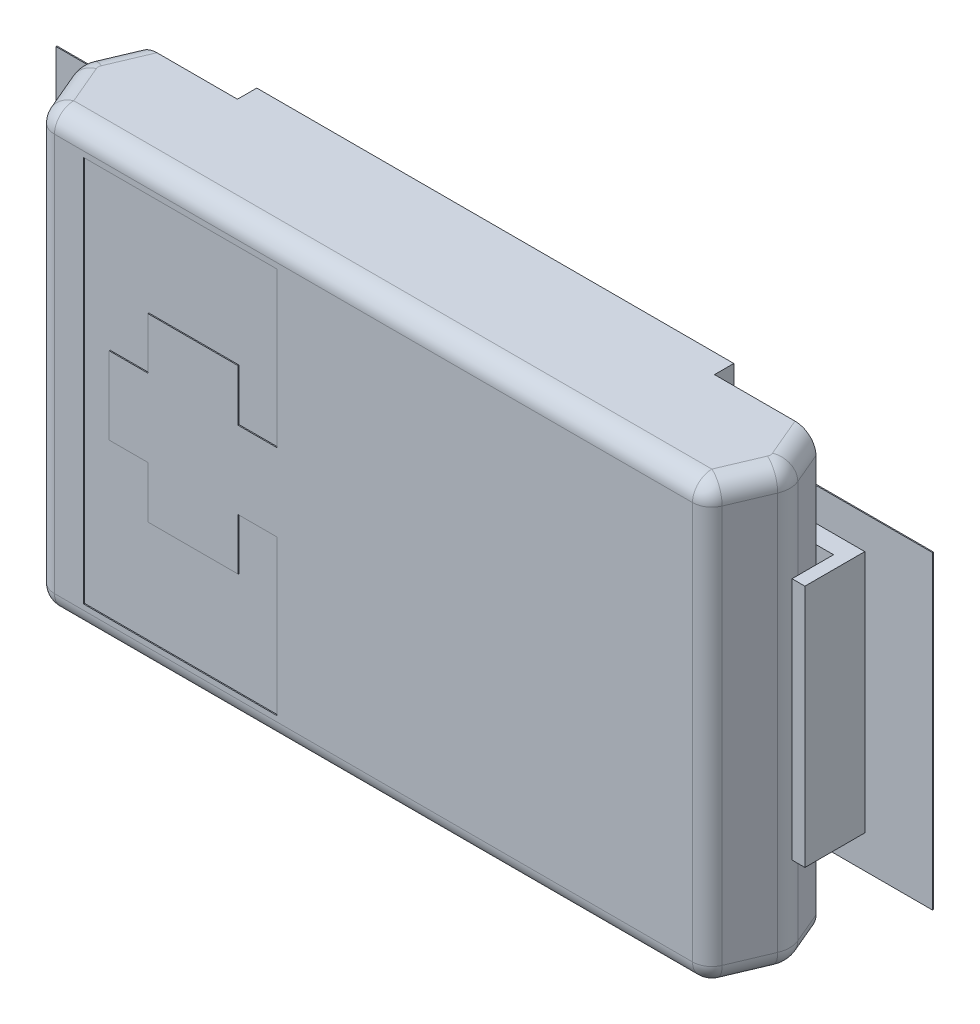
ISO-10303-21;
HEADER;
FILE_DESCRIPTION(('STEP AP214'),'2;1');
FILE_NAME('part.step','',(''),(''),'','','');
FILE_SCHEMA(('AUTOMOTIVE_DESIGN { 1 0 10303 214 1 1 1 1 }'));
ENDSEC;
DATA;
#1=APPLICATION_CONTEXT('core data for automotive mechanical design processes');
#2=APPLICATION_PROTOCOL_DEFINITION('international standard','automotive_design',2000,#1);
#3=PRODUCT_CONTEXT('',#1,'mechanical');
#4=PRODUCT('Part','Part','',(#3));
#5=PRODUCT_RELATED_PRODUCT_CATEGORY('part','',(#4));
#6=PRODUCT_DEFINITION_FORMATION('','',#4);
#7=PRODUCT_DEFINITION_CONTEXT('part definition',#1,'design');
#8=PRODUCT_DEFINITION('design','',#6,#7);
#9=PRODUCT_DEFINITION_SHAPE('','',#8);
#10=(LENGTH_UNIT() NAMED_UNIT(*) SI_UNIT(.MILLI.,.METRE.));
#11=(NAMED_UNIT(*) PLANE_ANGLE_UNIT() SI_UNIT($,.RADIAN.));
#12=(NAMED_UNIT(*) SI_UNIT($,.STERADIAN.) SOLID_ANGLE_UNIT());
#13=UNCERTAINTY_MEASURE_WITH_UNIT(LENGTH_MEASURE(1.E-05),#10,'distance_accuracy_value','');
#14=(GEOMETRIC_REPRESENTATION_CONTEXT(3) GLOBAL_UNCERTAINTY_ASSIGNED_CONTEXT((#13)) GLOBAL_UNIT_ASSIGNED_CONTEXT((#10,
#11,#12)) REPRESENTATION_CONTEXT('',''));
#15=CARTESIAN_POINT('',(0.,0.,0.));
#16=DIRECTION('',(0.,0.,1.));
#17=DIRECTION('',(1.,0.,0.));
#18=AXIS2_PLACEMENT_3D('',#15,#16,#17);
#19=CARTESIAN_POINT('',(-3.26900000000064,-2.15000000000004,0.0762));
#20=DIRECTION('',(0.920870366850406,0.,0.389868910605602));
#21=DIRECTION('',(0.389868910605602,0.,-0.920870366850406));
#22=AXIS2_PLACEMENT_3D('',#19,#20,#21);
#23=PLANE('',#22);
#24=DIRECTION('',(0.389868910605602,0.,-0.920870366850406));
#25=VECTOR('',#24,1.);
#26=CARTESIAN_POINT('',(-3.26900000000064,1.95950000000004,0.0762));
#27=LINE('',#26,#25);
#28=CARTESIAN_POINT('',(-3.34965198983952,1.95950000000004,0.2667));
#29=VERTEX_POINT('',#28);
#30=CARTESIAN_POINT('',(-3.48107506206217,1.95950000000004,0.57712129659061));
#31=VERTEX_POINT('',#30);
#32=EDGE_CURVE('E300',#29,#31,#27,.F.);
#33=ORIENTED_EDGE('',*,*,#32,.F.);
#34=DIRECTION('',(0.,1.,0.));
#35=VECTOR('',#34,1.);
#36=CARTESIAN_POINT('',(-3.3496519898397,-2.15000000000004,0.266699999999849));
#37=LINE('',#36,#35);
#38=CARTESIAN_POINT('',(-3.34965198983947,1.20000000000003,0.266699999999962));
#39=VERTEX_POINT('',#38);
#40=EDGE_CURVE('E274',#39,#29,#37,.T.);
#41=ORIENTED_EDGE('',*,*,#40,.F.);
#42=DIRECTION('',(0.,1.,0.));
#43=VECTOR('',#42,1.);
#44=CARTESIAN_POINT('',(-3.34965198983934,-1.20000000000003,0.2667));
#45=LINE('',#44,#43);
#46=CARTESIAN_POINT('',(-3.34965198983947,-1.20000000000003,0.266699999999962));
#47=VERTEX_POINT('',#46);
#48=EDGE_CURVE('E271',#47,#39,#45,.T.);
#49=ORIENTED_EDGE('',*,*,#48,.F.);
#50=DIRECTION('',(0.,1.,0.));
#51=VECTOR('',#50,1.);
#52=CARTESIAN_POINT('',(-3.3496519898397,-2.15000000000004,0.266699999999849));
#53=LINE('',#52,#51);
#54=CARTESIAN_POINT('',(-3.34965198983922,-1.95950000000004,0.2667));
#55=VERTEX_POINT('',#54);
#56=EDGE_CURVE('E264',#55,#47,#53,.T.);
#57=ORIENTED_EDGE('',*,*,#56,.F.);
#58=DIRECTION('',(0.389868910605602,0.,-0.920870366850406));
#59=VECTOR('',#58,1.);
#60=CARTESIAN_POINT('',(-3.26900000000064,-1.95950000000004,0.0762));
#61=LINE('',#60,#59);
#62=CARTESIAN_POINT('',(-3.48107506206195,-1.95950000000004,0.577121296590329));
#63=VERTEX_POINT('',#62);
#64=EDGE_CURVE('E268',#63,#55,#61,.T.);
#65=ORIENTED_EDGE('',*,*,#64,.F.);
#66=DIRECTION('',(0.,-1.,0.));
#67=VECTOR('',#66,1.);
#68=CARTESIAN_POINT('',(-3.48107506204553,2.16318829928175,0.577121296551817));
#69=LINE('',#68,#67);
#70=EDGE_CURVE('E620',#31,#63,#69,.T.);
#71=ORIENTED_EDGE('',*,*,#70,.F.);
#72=EDGE_LOOP('',(#33,#41,#49,#57,#65,#71));
#73=FACE_BOUND('',#72,.T.);
#74=ADVANCED_FACE('F16',(#73),#23,.F.);
#75=CARTESIAN_POINT('',(3.52300000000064,-2.15000000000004,0.676148));
#76=DIRECTION('',(-0.920870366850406,0.,0.389868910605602));
#77=DIRECTION('',(0.389868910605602,0.,0.920870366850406));
#78=AXIS2_PLACEMENT_3D('',#75,#76,#77);
#79=PLANE('',#78);
#80=DIRECTION('',(0.,1.,0.));
#81=VECTOR('',#80,1.);
#82=CARTESIAN_POINT('',(3.34965198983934,-1.20000000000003,0.2667));
#83=LINE('',#82,#81);
#84=CARTESIAN_POINT('',(3.34965198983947,1.20000000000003,0.266699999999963));
#85=VERTEX_POINT('',#84);
#86=CARTESIAN_POINT('',(3.34965198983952,-1.20000000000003,0.266699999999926));
#87=VERTEX_POINT('',#86);
#88=EDGE_CURVE('E315',#85,#87,#83,.F.);
#89=ORIENTED_EDGE('',*,*,#88,.F.);
#90=DIRECTION('',(0.,1.,0.));
#91=VECTOR('',#90,1.);
#92=CARTESIAN_POINT('',(3.34965198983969,-2.15000000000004,0.266699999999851));
#93=LINE('',#92,#91);
#94=CARTESIAN_POINT('',(3.34965198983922,1.95950000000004,0.2667));
#95=VERTEX_POINT('',#94);
#96=EDGE_CURVE('E306',#95,#85,#93,.F.);
#97=ORIENTED_EDGE('',*,*,#96,.F.);
#98=DIRECTION('',(0.389868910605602,0.,0.920870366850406));
#99=VECTOR('',#98,1.);
#100=CARTESIAN_POINT('',(3.52300000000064,1.95950000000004,0.676148));
#101=LINE('',#100,#99);
#102=CARTESIAN_POINT('',(3.48107506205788,1.95950000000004,0.577121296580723));
#103=VERTEX_POINT('',#102);
#104=EDGE_CURVE('E310',#103,#95,#101,.F.);
#105=ORIENTED_EDGE('',*,*,#104,.F.);
#106=DIRECTION('',(0.,-1.,0.));
#107=VECTOR('',#106,1.);
#108=CARTESIAN_POINT('',(3.48107506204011,2.16318829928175,0.577121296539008));
#109=LINE('',#108,#107);
#110=CARTESIAN_POINT('',(3.48107506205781,-1.95950000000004,0.577121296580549));
#111=VERTEX_POINT('',#110);
#112=EDGE_CURVE('E608',#111,#103,#109,.F.);
#113=ORIENTED_EDGE('',*,*,#112,.F.);
#114=DIRECTION('',(0.389868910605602,0.,0.920870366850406));
#115=VECTOR('',#114,1.);
#116=CARTESIAN_POINT('',(3.52300000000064,-1.95950000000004,0.676148));
#117=LINE('',#116,#115);
#118=CARTESIAN_POINT('',(3.34965198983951,-1.95950000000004,0.2667));
#119=VERTEX_POINT('',#118);
#120=EDGE_CURVE('E303',#119,#111,#117,.T.);
#121=ORIENTED_EDGE('',*,*,#120,.F.);
#122=DIRECTION('',(0.,1.,0.));
#123=VECTOR('',#122,1.);
#124=CARTESIAN_POINT('',(3.34965198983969,-2.15000000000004,0.266699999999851));
#125=LINE('',#124,#123);
#126=EDGE_CURVE('E309',#87,#119,#125,.F.);
#127=ORIENTED_EDGE('',*,*,#126,.F.);
#128=EDGE_LOOP('',(#89,#97,#105,#113,#121,#127));
#129=FACE_BOUND('',#128,.T.);
#130=ADVANCED_FACE('F950',(#129),#79,.F.);
#131=CARTESIAN_POINT('',(-3.52300000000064,-1.20000000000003,0.2667));
#132=DIRECTION('',(0.,0.,1.));
#133=DIRECTION('',(1.,0.,0.));
#134=AXIS2_PLACEMENT_3D('',#131,#132,#133);
#135=PLANE('',#134);
#136=DIRECTION('',(1.,0.,0.));
#137=VECTOR('',#136,1.);
#138=CARTESIAN_POINT('',(-3.52300000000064,-1.20000000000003,0.2667));
#139=LINE('',#138,#137);
#140=CARTESIAN_POINT('',(-3.52300000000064,-1.20000000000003,0.2667));
#141=VERTEX_POINT('',#140);
#142=EDGE_CURVE('E335',#141,#47,#139,.T.);
#143=ORIENTED_EDGE('',*,*,#142,.T.);
#144=ORIENTED_EDGE('',*,*,#48,.T.);
#145=DIRECTION('',(1.,0.,0.));
#146=VECTOR('',#145,1.);
#147=CARTESIAN_POINT('',(-3.52300000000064,1.20000000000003,0.2667));
#148=LINE('',#147,#146);
#149=CARTESIAN_POINT('',(-3.52300000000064,1.20000000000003,0.2667));
#150=VERTEX_POINT('',#149);
#151=EDGE_CURVE('E337',#39,#150,#148,.F.);
#152=ORIENTED_EDGE('',*,*,#151,.T.);
#153=DIRECTION('',(0.,1.,0.));
#154=VECTOR('',#153,1.);
#155=CARTESIAN_POINT('',(-3.52300000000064,-1.20000000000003,0.2667));
#156=LINE('',#155,#154);
#157=EDGE_CURVE('E348',#141,#150,#156,.T.);
#158=ORIENTED_EDGE('',*,*,#157,.F.);
#159=EDGE_LOOP('',(#143,#144,#152,#158));
#160=FACE_BOUND('',#159,.T.);
#161=ADVANCED_FACE('F660',(#160),#135,.T.);
#162=CARTESIAN_POINT('',(2.35,-1.20000000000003,0.2667));
#163=DIRECTION('',(0.,0.,1.));
#164=DIRECTION('',(1.,0.,0.));
#165=AXIS2_PLACEMENT_3D('',#162,#163,#164);
#166=PLANE('',#165);
#167=DIRECTION('',(1.,0.,0.));
#168=VECTOR('',#167,1.);
#169=CARTESIAN_POINT('',(2.35,1.20000000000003,0.2667));
#170=LINE('',#169,#168);
#171=CARTESIAN_POINT('',(3.52300000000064,1.20000000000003,0.2667));
#172=VERTEX_POINT('',#171);
#173=EDGE_CURVE('E313',#172,#85,#170,.F.);
#174=ORIENTED_EDGE('',*,*,#173,.T.);
#175=ORIENTED_EDGE('',*,*,#88,.T.);
#176=DIRECTION('',(1.,0.,0.));
#177=VECTOR('',#176,1.);
#178=CARTESIAN_POINT('',(2.35,-1.20000000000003,0.2667));
#179=LINE('',#178,#177);
#180=CARTESIAN_POINT('',(3.52300000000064,-1.20000000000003,0.2667));
#181=VERTEX_POINT('',#180);
#182=EDGE_CURVE('E316',#87,#181,#179,.T.);
#183=ORIENTED_EDGE('',*,*,#182,.T.);
#184=DIRECTION('',(0.,1.,0.));
#185=VECTOR('',#184,1.);
#186=CARTESIAN_POINT('',(3.52300000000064,-1.20000000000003,0.2667));
#187=LINE('',#186,#185);
#188=EDGE_CURVE('E326',#172,#181,#187,.F.);
#189=ORIENTED_EDGE('',*,*,#188,.F.);
#190=EDGE_LOOP('',(#174,#175,#183,#189));
#191=FACE_BOUND('',#190,.T.);
#192=ADVANCED_FACE('F944',(#191),#166,.T.);
#193=CARTESIAN_POINT('',(-3.24717398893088,2.16318829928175,0.676148));
#194=DIRECTION('',(0.,-1.,0.));
#195=DIRECTION('',(0.,0.,-1.));
#196=AXIS2_PLACEMENT_3D('',#193,#194,#195);
#197=CYLINDRICAL_SURFACE('',#196,0.254);
#198=ORIENTED_EDGE('',*,*,#70,.T.);
#199=CARTESIAN_POINT('',(-3.24717398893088,-1.95950000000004,0.676148));
#200=DIRECTION('',(0.,-1.,0.));
#201=DIRECTION('',(0.,0.,-1.));
#202=AXIS2_PLACEMENT_3D('',#199,#200,#201);
#203=CIRCLE('',#202,0.254);
#204=CARTESIAN_POINT('',(-3.48107506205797,-1.95950000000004,0.775174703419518));
#205=VERTEX_POINT('',#204);
#206=EDGE_CURVE('E623',#63,#205,#203,.F.);
#207=ORIENTED_EDGE('',*,*,#206,.T.);
#208=DIRECTION('',(0.,1.,0.));
#209=VECTOR('',#208,1.);
#210=CARTESIAN_POINT('',(-3.48107506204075,-2.15000000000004,0.775174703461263));
#211=LINE('',#210,#209);
#212=CARTESIAN_POINT('',(-3.4810750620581,1.95950000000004,0.775174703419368));
#213=VERTEX_POINT('',#212);
#214=EDGE_CURVE('E593',#205,#213,#211,.T.);
#215=ORIENTED_EDGE('',*,*,#214,.T.);
#216=CARTESIAN_POINT('',(-3.24717398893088,1.95950000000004,0.676148));
#217=DIRECTION('',(0.,-1.,0.));
#218=DIRECTION('',(0.,0.,-1.));
#219=AXIS2_PLACEMENT_3D('',#216,#217,#218);
#220=CIRCLE('',#219,0.254);
#221=EDGE_CURVE('E321',#213,#31,#220,.T.);
#222=ORIENTED_EDGE('',*,*,#221,.T.);
#223=EDGE_LOOP('',(#198,#207,#215,#222));
#224=FACE_BOUND('',#223,.T.);
#225=ADVANCED_FACE('F638',(#224),#197,.T.);
#226=CARTESIAN_POINT('',(3.24717398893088,2.16318829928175,0.676148));
#227=DIRECTION('',(0.,-1.,0.));
#228=DIRECTION('',(0.,0.,-1.));
#229=AXIS2_PLACEMENT_3D('',#226,#227,#228);
#230=CYLINDRICAL_SURFACE('',#229,0.254);
#231=DIRECTION('',(0.,1.,0.));
#232=VECTOR('',#231,1.);
#233=CARTESIAN_POINT('',(3.48107506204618,-2.15000000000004,0.775174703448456));
#234=LINE('',#233,#232);
#235=CARTESIAN_POINT('',(3.48107506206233,1.95950000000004,0.775174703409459));
#236=VERTEX_POINT('',#235);
#237=CARTESIAN_POINT('',(3.48107506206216,-1.95950000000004,0.775174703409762));
#238=VERTEX_POINT('',#237);
#239=EDGE_CURVE('E583',#236,#238,#234,.F.);
#240=ORIENTED_EDGE('',*,*,#239,.T.);
#241=CARTESIAN_POINT('',(3.24717398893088,-1.95950000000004,0.676148));
#242=DIRECTION('',(0.,-1.,0.));
#243=DIRECTION('',(0.,0.,-1.));
#244=AXIS2_PLACEMENT_3D('',#241,#242,#243);
#245=CIRCLE('',#244,0.254);
#246=EDGE_CURVE('E351',#238,#111,#245,.F.);
#247=ORIENTED_EDGE('',*,*,#246,.T.);
#248=ORIENTED_EDGE('',*,*,#112,.T.);
#249=CARTESIAN_POINT('',(3.24717398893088,1.95950000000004,0.676148));
#250=DIRECTION('',(0.,-1.,0.));
#251=DIRECTION('',(0.,0.,-1.));
#252=AXIS2_PLACEMENT_3D('',#249,#250,#251);
#253=CIRCLE('',#252,0.254);
#254=EDGE_CURVE('E606',#103,#236,#253,.T.);
#255=ORIENTED_EDGE('',*,*,#254,.T.);
#256=EDGE_LOOP('',(#240,#247,#248,#255));
#257=FACE_BOUND('',#256,.T.);
#258=ADVANCED_FACE('F938',(#257),#230,.T.);
#259=CARTESIAN_POINT('',(-3.52300000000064,-1.20000000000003,0.676148));
#260=DIRECTION('',(1.,0.,0.));
#261=DIRECTION('',(0.,0.,-1.));
#262=AXIS2_PLACEMENT_3D('',#259,#260,#261);
#263=PLANE('',#262);
#264=DIRECTION('',(0.,1.,0.));
#265=VECTOR('',#264,1.);
#266=CARTESIAN_POINT('',(-3.52300000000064,-1.20000000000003,0.676148));
#267=LINE('',#266,#265);
#268=CARTESIAN_POINT('',(-3.52300000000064,-1.20000000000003,0.676148));
#269=VERTEX_POINT('',#268);
#270=CARTESIAN_POINT('',(-3.52300000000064,1.20000000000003,0.676148));
#271=VERTEX_POINT('',#270);
#272=EDGE_CURVE('E553',#269,#271,#267,.T.);
#273=ORIENTED_EDGE('',*,*,#272,.F.);
#274=DIRECTION('',(0.,0.,-1.));
#275=VECTOR('',#274,1.);
#276=CARTESIAN_POINT('',(-3.52300000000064,-1.20000000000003,0.676148));
#277=LINE('',#276,#275);
#278=EDGE_CURVE('E327',#269,#141,#277,.T.);
#279=ORIENTED_EDGE('',*,*,#278,.T.);
#280=ORIENTED_EDGE('',*,*,#157,.T.);
#281=DIRECTION('',(0.,0.,-1.));
#282=VECTOR('',#281,1.);
#283=CARTESIAN_POINT('',(-3.52300000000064,1.20000000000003,0.676148));
#284=LINE('',#283,#282);
#285=EDGE_CURVE('E345',#150,#271,#284,.F.);
#286=ORIENTED_EDGE('',*,*,#285,.T.);
#287=EDGE_LOOP('',(#273,#279,#280,#286));
#288=FACE_BOUND('',#287,.T.);
#289=ADVANCED_FACE('F670',(#288),#263,.T.);
#290=CARTESIAN_POINT('',(3.52300000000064,-1.20000000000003,0.2667));
#291=DIRECTION('',(-1.,0.,0.));
#292=DIRECTION('',(0.,0.,1.));
#293=AXIS2_PLACEMENT_3D('',#290,#291,#292);
#294=PLANE('',#293);
#295=ORIENTED_EDGE('',*,*,#188,.T.);
#296=DIRECTION('',(0.,0.,1.));
#297=VECTOR('',#296,1.);
#298=CARTESIAN_POINT('',(3.52300000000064,-1.20000000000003,0.2667));
#299=LINE('',#298,#297);
#300=CARTESIAN_POINT('',(3.52300000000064,-1.20000000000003,0.676148));
#301=VERTEX_POINT('',#300);
#302=EDGE_CURVE('E100',#181,#301,#299,.T.);
#303=ORIENTED_EDGE('',*,*,#302,.T.);
#304=DIRECTION('',(0.,1.,0.));
#305=VECTOR('',#304,1.);
#306=CARTESIAN_POINT('',(3.52300000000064,-1.20000000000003,0.676148));
#307=LINE('',#306,#305);
#308=CARTESIAN_POINT('',(3.52300000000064,1.20000000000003,0.676148));
#309=VERTEX_POINT('',#308);
#310=EDGE_CURVE('E531',#309,#301,#307,.F.);
#311=ORIENTED_EDGE('',*,*,#310,.F.);
#312=DIRECTION('',(0.,0.,1.));
#313=VECTOR('',#312,1.);
#314=CARTESIAN_POINT('',(3.52300000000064,1.20000000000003,0.2667));
#315=LINE('',#314,#313);
#316=EDGE_CURVE('E324',#309,#172,#315,.F.);
#317=ORIENTED_EDGE('',*,*,#316,.T.);
#318=EDGE_LOOP('',(#295,#303,#311,#317));
#319=FACE_BOUND('',#318,.T.);
#320=ADVANCED_FACE('F932',(#319),#294,.T.);
#321=CARTESIAN_POINT('',(-3.52300000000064,-2.15000000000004,0.676148));
#322=DIRECTION('',(0.920870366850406,0.,-0.389868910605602));
#323=DIRECTION('',(-0.389868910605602,0.,-0.920870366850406));
#324=AXIS2_PLACEMENT_3D('',#321,#322,#323);
#325=PLANE('',#324);
#326=DIRECTION('',(-0.389868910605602,0.,-0.920870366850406));
#327=VECTOR('',#326,1.);
#328=CARTESIAN_POINT('',(-3.52300000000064,1.95950000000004,0.676148));
#329=LINE('',#328,#327);
#330=CARTESIAN_POINT('',(-3.31820828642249,1.95950000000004,1.15986602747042));
#331=VERTEX_POINT('',#330);
#332=EDGE_CURVE('E586',#213,#331,#329,.F.);
#333=ORIENTED_EDGE('',*,*,#332,.F.);
#334=ORIENTED_EDGE('',*,*,#214,.F.);
#335=DIRECTION('',(-0.389868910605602,0.,-0.920870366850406));
#336=VECTOR('',#335,1.);
#337=CARTESIAN_POINT('',(-3.52300000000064,-1.95950000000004,0.676148));
#338=LINE('',#337,#336);
#339=CARTESIAN_POINT('',(-3.31820828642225,-1.95950000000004,1.15986602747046));
#340=VERTEX_POINT('',#339);
#341=EDGE_CURVE('E596',#340,#205,#338,.T.);
#342=ORIENTED_EDGE('',*,*,#341,.F.);
#343=DIRECTION('',(0.,-1.,0.));
#344=VECTOR('',#343,1.);
#345=CARTESIAN_POINT('',(-3.31820828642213,2.16318829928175,1.15986602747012));
#346=LINE('',#345,#344);
#347=EDGE_CURVE('E503',#331,#340,#346,.T.);
#348=ORIENTED_EDGE('',*,*,#347,.F.);
#349=EDGE_LOOP('',(#333,#334,#342,#348));
#350=FACE_BOUND('',#349,.T.);
#351=ADVANCED_FACE('F929',(#350),#325,.F.);
#352=CARTESIAN_POINT('',(3.26900000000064,-2.15000000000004,1.276096));
#353=DIRECTION('',(-0.920870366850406,0.,-0.389868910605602));
#354=DIRECTION('',(-0.389868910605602,0.,0.920870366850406));
#355=AXIS2_PLACEMENT_3D('',#352,#353,#354);
#356=PLANE('',#355);
#357=DIRECTION('',(-0.389868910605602,0.,0.920870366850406));
#358=VECTOR('',#357,1.);
#359=CARTESIAN_POINT('',(3.26900000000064,1.95950000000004,1.276096));
#360=LINE('',#359,#358);
#361=CARTESIAN_POINT('',(3.31820828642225,1.95950000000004,1.15986602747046));
#362=VERTEX_POINT('',#361);
#363=EDGE_CURVE('E88',#362,#236,#360,.F.);
#364=ORIENTED_EDGE('',*,*,#363,.F.);
#365=DIRECTION('',(0.,1.,0.));
#366=VECTOR('',#365,1.);
#367=CARTESIAN_POINT('',(3.31820828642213,-2.16487500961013,1.15986602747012));
#368=LINE('',#367,#366);
#369=CARTESIAN_POINT('',(3.31820828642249,-1.95950000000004,1.15986602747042));
#370=VERTEX_POINT('',#369);
#371=EDGE_CURVE('E502',#370,#362,#368,.T.);
#372=ORIENTED_EDGE('',*,*,#371,.F.);
#373=DIRECTION('',(-0.389868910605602,0.,0.920870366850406));
#374=VECTOR('',#373,1.);
#375=CARTESIAN_POINT('',(3.26900000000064,-1.95950000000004,1.276096));
#376=LINE('',#375,#374);
#377=EDGE_CURVE('E584',#238,#370,#376,.T.);
#378=ORIENTED_EDGE('',*,*,#377,.F.);
#379=ORIENTED_EDGE('',*,*,#239,.F.);
#380=EDGE_LOOP('',(#364,#372,#378,#379));
#381=FACE_BOUND('',#380,.T.);
#382=ADVANCED_FACE('F925',(#381),#356,.F.);
#383=CARTESIAN_POINT('',(0.,0.,1.265936));
#384=DIRECTION('',(0.,0.,1.));
#385=DIRECTION('',(1.,0.,0.));
#386=AXIS2_PLACEMENT_3D('',#383,#384,#385);
#387=PLANE('',#386);
#388=DIRECTION('',(0.,1.,0.));
#389=VECTOR('',#388,1.);
#390=CARTESIAN_POINT('',(-2.8575,1.905,1.265936));
#391=LINE('',#390,#389);
#392=CARTESIAN_POINT('',(-2.8575,1.905,1.265936));
#393=VERTEX_POINT('',#392);
#394=CARTESIAN_POINT('',(-2.8575,-1.905,1.265936));
#395=VERTEX_POINT('',#394);
#396=EDGE_CURVE('E493',#393,#395,#391,.F.);
#397=ORIENTED_EDGE('',*,*,#396,.T.);
#398=DIRECTION('',(1.,0.,0.));
#399=VECTOR('',#398,1.);
#400=CARTESIAN_POINT('',(-2.8575,-1.905,1.265936));
#401=LINE('',#400,#399);
#402=CARTESIAN_POINT('',(-0.9525,-1.905,1.265936));
#403=VERTEX_POINT('',#402);
#404=EDGE_CURVE('E499',#395,#403,#401,.T.);
#405=ORIENTED_EDGE('',*,*,#404,.T.);
#406=DIRECTION('',(0.,1.,0.));
#407=VECTOR('',#406,1.);
#408=CARTESIAN_POINT('',(-0.9525,0.,1.265936));
#409=LINE('',#408,#407);
#410=CARTESIAN_POINT('',(-0.9525,-0.381,1.265936));
#411=VERTEX_POINT('',#410);
#412=EDGE_CURVE('E581',#403,#411,#409,.T.);
#413=ORIENTED_EDGE('',*,*,#412,.T.);
#414=DIRECTION('',(1.,0.,0.));
#415=VECTOR('',#414,1.);
#416=CARTESIAN_POINT('',(0.,-0.381,1.265936));
#417=LINE('',#416,#415);
#418=CARTESIAN_POINT('',(-1.3335,-0.381,1.265936));
#419=VERTEX_POINT('',#418);
#420=EDGE_CURVE('E579',#411,#419,#417,.F.);
#421=ORIENTED_EDGE('',*,*,#420,.T.);
#422=DIRECTION('',(0.,1.,0.));
#423=VECTOR('',#422,1.);
#424=CARTESIAN_POINT('',(-1.3335,0.,1.265936));
#425=LINE('',#424,#423);
#426=CARTESIAN_POINT('',(-1.3335,-0.889,1.265936));
#427=VERTEX_POINT('',#426);
#428=EDGE_CURVE('E577',#419,#427,#425,.F.);
#429=ORIENTED_EDGE('',*,*,#428,.T.);
#430=DIRECTION('',(1.,0.,0.));
#431=VECTOR('',#430,1.);
#432=CARTESIAN_POINT('',(0.,-0.889,1.265936));
#433=LINE('',#432,#431);
#434=CARTESIAN_POINT('',(-2.2225,-0.889,1.265936));
#435=VERTEX_POINT('',#434);
#436=EDGE_CURVE('E575',#427,#435,#433,.F.);
#437=ORIENTED_EDGE('',*,*,#436,.T.);
#438=DIRECTION('',(0.,1.,0.));
#439=VECTOR('',#438,1.);
#440=CARTESIAN_POINT('',(-2.2225,0.,1.265936));
#441=LINE('',#440,#439);
#442=CARTESIAN_POINT('',(-2.2225,-0.381,1.265936));
#443=VERTEX_POINT('',#442);
#444=EDGE_CURVE('E573',#435,#443,#441,.T.);
#445=ORIENTED_EDGE('',*,*,#444,.T.);
#446=DIRECTION('',(1.,0.,0.));
#447=VECTOR('',#446,1.);
#448=CARTESIAN_POINT('',(0.,-0.381,1.265936));
#449=LINE('',#448,#447);
#450=CARTESIAN_POINT('',(-2.6035,-0.381,1.265936));
#451=VERTEX_POINT('',#450);
#452=EDGE_CURVE('E571',#443,#451,#449,.F.);
#453=ORIENTED_EDGE('',*,*,#452,.T.);
#454=DIRECTION('',(0.,1.,0.));
#455=VECTOR('',#454,1.);
#456=CARTESIAN_POINT('',(-2.6035,0.,1.265936));
#457=LINE('',#456,#455);
#458=CARTESIAN_POINT('',(-2.6035,0.381,1.265936));
#459=VERTEX_POINT('',#458);
#460=EDGE_CURVE('E569',#451,#459,#457,.T.);
#461=ORIENTED_EDGE('',*,*,#460,.T.);
#462=DIRECTION('',(1.,0.,0.));
#463=VECTOR('',#462,1.);
#464=CARTESIAN_POINT('',(0.,0.381,1.265936));
#465=LINE('',#464,#463);
#466=CARTESIAN_POINT('',(-2.2225,0.381,1.265936));
#467=VERTEX_POINT('',#466);
#468=EDGE_CURVE('E567',#459,#467,#465,.T.);
#469=ORIENTED_EDGE('',*,*,#468,.T.);
#470=DIRECTION('',(0.,1.,0.));
#471=VECTOR('',#470,1.);
#472=CARTESIAN_POINT('',(-2.2225,0.,1.265936));
#473=LINE('',#472,#471);
#474=CARTESIAN_POINT('',(-2.2225,0.889,1.265936));
#475=VERTEX_POINT('',#474);
#476=EDGE_CURVE('E565',#467,#475,#473,.T.);
#477=ORIENTED_EDGE('',*,*,#476,.T.);
#478=DIRECTION('',(1.,0.,0.));
#479=VECTOR('',#478,1.);
#480=CARTESIAN_POINT('',(0.,0.889,1.265936));
#481=LINE('',#480,#479);
#482=CARTESIAN_POINT('',(-1.3335,0.889,1.265936));
#483=VERTEX_POINT('',#482);
#484=EDGE_CURVE('E563',#475,#483,#481,.T.);
#485=ORIENTED_EDGE('',*,*,#484,.T.);
#486=DIRECTION('',(0.,1.,0.));
#487=VECTOR('',#486,1.);
#488=CARTESIAN_POINT('',(-1.3335,0.,1.265936));
#489=LINE('',#488,#487);
#490=CARTESIAN_POINT('',(-1.3335,0.381,1.265936));
#491=VERTEX_POINT('',#490);
#492=EDGE_CURVE('E561',#483,#491,#489,.F.);
#493=ORIENTED_EDGE('',*,*,#492,.T.);
#494=DIRECTION('',(1.,0.,0.));
#495=VECTOR('',#494,1.);
#496=CARTESIAN_POINT('',(0.,0.381,1.265936));
#497=LINE('',#496,#495);
#498=CARTESIAN_POINT('',(-0.9525,0.381,1.265936));
#499=VERTEX_POINT('',#498);
#500=EDGE_CURVE('E559',#491,#499,#497,.T.);
#501=ORIENTED_EDGE('',*,*,#500,.T.);
#502=DIRECTION('',(0.,1.,0.));
#503=VECTOR('',#502,1.);
#504=CARTESIAN_POINT('',(-0.9525,0.,1.265936));
#505=LINE('',#504,#503);
#506=CARTESIAN_POINT('',(-0.9525,1.905,1.265936));
#507=VERTEX_POINT('',#506);
#508=EDGE_CURVE('E556',#499,#507,#505,.T.);
#509=ORIENTED_EDGE('',*,*,#508,.T.);
#510=DIRECTION('',(1.,0.,0.));
#511=VECTOR('',#510,1.);
#512=CARTESIAN_POINT('',(-0.9525,1.905,1.265936));
#513=LINE('',#512,#511);
#514=EDGE_CURVE('E490',#507,#393,#513,.F.);
#515=ORIENTED_EDGE('',*,*,#514,.T.);
#516=EDGE_LOOP('',(#397,#405,#413,#421,#429,#437,#445,#453,#461,#469,#477,#485,#493,#501,#509,#515));
#517=FACE_BOUND('',#516,.T.);
#518=ADVANCED_FACE('F922',(#517),#387,.T.);
#519=CARTESIAN_POINT('',(-3.65000000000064,-1.20000000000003,0.676148));
#520=DIRECTION('',(0.,0.,1.));
#521=DIRECTION('',(1.,0.,0.));
#522=AXIS2_PLACEMENT_3D('',#519,#520,#521);
#523=PLANE('',#522);
#524=DIRECTION('',(0.,1.,0.));
#525=VECTOR('',#524,1.);
#526=CARTESIAN_POINT('',(-3.65000000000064,-1.20000000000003,0.676148));
#527=LINE('',#526,#525);
#528=CARTESIAN_POINT('',(-3.65000000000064,-1.20000000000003,0.676148));
#529=VERTEX_POINT('',#528);
#530=CARTESIAN_POINT('',(-3.65000000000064,1.20000000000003,0.676148));
#531=VERTEX_POINT('',#530);
#532=EDGE_CURVE('E438',#529,#531,#527,.T.);
#533=ORIENTED_EDGE('',*,*,#532,.F.);
#534=DIRECTION('',(1.,0.,0.));
#535=VECTOR('',#534,1.);
#536=CARTESIAN_POINT('',(-3.65000000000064,-1.20000000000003,0.676148));
#537=LINE('',#536,#535);
#538=EDGE_CURVE('E535',#529,#269,#537,.T.);
#539=ORIENTED_EDGE('',*,*,#538,.T.);
#540=ORIENTED_EDGE('',*,*,#272,.T.);
#541=DIRECTION('',(1.,0.,0.));
#542=VECTOR('',#541,1.);
#543=CARTESIAN_POINT('',(-3.65000000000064,1.20000000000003,0.676148));
#544=LINE('',#543,#542);
#545=EDGE_CURVE('E550',#271,#531,#544,.F.);
#546=ORIENTED_EDGE('',*,*,#545,.T.);
#547=EDGE_LOOP('',(#533,#539,#540,#546));
#548=FACE_BOUND('',#547,.T.);
#549=ADVANCED_FACE('F673',(#548),#523,.T.);
#550=CARTESIAN_POINT('',(3.52300000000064,-1.20000000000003,0.676148));
#551=DIRECTION('',(0.,0.,1.));
#552=DIRECTION('',(1.,0.,0.));
#553=AXIS2_PLACEMENT_3D('',#550,#551,#552);
#554=PLANE('',#553);
#555=ORIENTED_EDGE('',*,*,#310,.T.);
#556=DIRECTION('',(1.,0.,0.));
#557=VECTOR('',#556,1.);
#558=CARTESIAN_POINT('',(3.52300000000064,-1.20000000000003,0.676148));
#559=LINE('',#558,#557);
#560=CARTESIAN_POINT('',(3.65000000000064,-1.20000000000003,0.676148));
#561=VERTEX_POINT('',#560);
#562=EDGE_CURVE('E506',#301,#561,#559,.T.);
#563=ORIENTED_EDGE('',*,*,#562,.T.);
#564=DIRECTION('',(0.,1.,0.));
#565=VECTOR('',#564,1.);
#566=CARTESIAN_POINT('',(3.65000000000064,-1.20000000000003,0.676148));
#567=LINE('',#566,#565);
#568=CARTESIAN_POINT('',(3.65000000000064,1.20000000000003,0.676148));
#569=VERTEX_POINT('',#568);
#570=EDGE_CURVE('E422',#569,#561,#567,.F.);
#571=ORIENTED_EDGE('',*,*,#570,.F.);
#572=DIRECTION('',(1.,0.,0.));
#573=VECTOR('',#572,1.);
#574=CARTESIAN_POINT('',(3.52300000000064,1.20000000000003,0.676148));
#575=LINE('',#574,#573);
#576=EDGE_CURVE('E533',#569,#309,#575,.F.);
#577=ORIENTED_EDGE('',*,*,#576,.T.);
#578=EDGE_LOOP('',(#555,#563,#571,#577));
#579=FACE_BOUND('',#578,.T.);
#580=ADVANCED_FACE('F804',(#579),#554,.T.);
#581=CARTESIAN_POINT('',(-3.14278248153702,2.16318829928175,1.085596));
#582=DIRECTION('',(0.,-1.,0.));
#583=DIRECTION('',(0.,0.,-1.));
#584=AXIS2_PLACEMENT_3D('',#581,#582,#583);
#585=CYLINDRICAL_SURFACE('',#584,0.1905);
#586=CARTESIAN_POINT('',(-3.14278248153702,-1.95950000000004,1.085596));
#587=DIRECTION('',(0.,-1.,0.));
#588=DIRECTION('',(0.,0.,-1.));
#589=AXIS2_PLACEMENT_3D('',#586,#587,#588);
#590=CIRCLE('',#589,0.1905);
#591=CARTESIAN_POINT('',(-3.14278248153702,-1.95950000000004,1.276096));
#592=VERTEX_POINT('',#591);
#593=EDGE_CURVE('E420',#592,#340,#590,.T.);
#594=ORIENTED_EDGE('',*,*,#593,.F.);
#595=DIRECTION('',(0.,1.,0.));
#596=VECTOR('',#595,1.);
#597=CARTESIAN_POINT('',(-3.14278248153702,0.,1.276096));
#598=LINE('',#597,#596);
#599=CARTESIAN_POINT('',(-3.14278248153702,1.95950000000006,1.276096));
#600=VERTEX_POINT('',#599);
#601=EDGE_CURVE('E1222',#600,#592,#598,.F.);
#602=ORIENTED_EDGE('',*,*,#601,.F.);
#603=CARTESIAN_POINT('',(-3.14278248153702,1.95950000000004,1.085596));
#604=DIRECTION('',(-4.02677891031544E-13,1.,-2.66675570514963E-13));
#605=DIRECTION('',(-0.552327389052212,0.,0.833627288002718));
#606=AXIS2_PLACEMENT_3D('',#603,#604,#605);
#607=CIRCLE('',#606,0.1905);
#608=CARTESIAN_POINT('',(-3.24800084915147,1.95950000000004,1.24440199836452));
#609=VERTEX_POINT('',#608);
#610=EDGE_CURVE('E418',#609,#600,#607,.T.);
#611=ORIENTED_EDGE('',*,*,#610,.F.);
#612=CARTESIAN_POINT('',(-3.14278248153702,1.95950000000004,1.085596));
#613=DIRECTION('',(0.,-1.,0.));
#614=DIRECTION('',(0.,0.,-1.));
#615=AXIS2_PLACEMENT_3D('',#612,#613,#614);
#616=CIRCLE('',#615,0.1905);
#617=EDGE_CURVE('E416',#331,#609,#616,.F.);
#618=ORIENTED_EDGE('',*,*,#617,.F.);
#619=ORIENTED_EDGE('',*,*,#347,.T.);
#620=EDGE_LOOP('',(#594,#602,#611,#618,#619));
#621=FACE_BOUND('',#620,.T.);
#622=ADVANCED_FACE('F913',(#621),#585,.T.);
#623=CARTESIAN_POINT('',(3.14278248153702,-2.16487500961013,1.085596));
#624=DIRECTION('',(0.,1.,0.));
#625=DIRECTION('',(0.,0.,1.));
#626=AXIS2_PLACEMENT_3D('',#623,#624,#625);
#627=CYLINDRICAL_SURFACE('',#626,0.1905);
#628=CARTESIAN_POINT('',(3.14278248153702,-1.95950000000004,1.085596));
#629=DIRECTION('',(0.,1.,0.));
#630=DIRECTION('',(0.,0.,1.));
#631=AXIS2_PLACEMENT_3D('',#628,#629,#630);
#632=CIRCLE('',#631,0.1905);
#633=CARTESIAN_POINT('',(3.24800084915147,-1.95950000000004,1.24440199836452));
#634=VERTEX_POINT('',#633);
#635=EDGE_CURVE('E424',#370,#634,#632,.F.);
#636=ORIENTED_EDGE('',*,*,#635,.F.);
#637=ORIENTED_EDGE('',*,*,#371,.T.);
#638=CARTESIAN_POINT('',(3.14278248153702,1.95950000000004,1.085596));
#639=DIRECTION('',(0.,1.,0.));
#640=DIRECTION('',(0.,0.,1.));
#641=AXIS2_PLACEMENT_3D('',#638,#639,#640);
#642=CIRCLE('',#641,0.1905);
#643=CARTESIAN_POINT('',(3.14278248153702,1.95950000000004,1.276096));
#644=VERTEX_POINT('',#643);
#645=EDGE_CURVE('E20',#362,#644,#642,.F.);
#646=ORIENTED_EDGE('',*,*,#645,.T.);
#647=DIRECTION('',(0.,1.,0.));
#648=VECTOR('',#647,1.);
#649=CARTESIAN_POINT('',(3.14278248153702,0.,1.276096));
#650=LINE('',#649,#648);
#651=CARTESIAN_POINT('',(3.14278248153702,-1.95950000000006,1.276096));
#652=VERTEX_POINT('',#651);
#653=EDGE_CURVE('E1219',#652,#644,#650,.T.);
#654=ORIENTED_EDGE('',*,*,#653,.F.);
#655=CARTESIAN_POINT('',(3.14278248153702,-1.95950000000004,1.085596));
#656=DIRECTION('',(4.02677891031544E-13,-1.,-2.66675570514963E-13));
#657=DIRECTION('',(0.552327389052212,0.,0.833627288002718));
#658=AXIS2_PLACEMENT_3D('',#655,#656,#657);
#659=CIRCLE('',#658,0.1905);
#660=EDGE_CURVE('E423',#634,#652,#659,.T.);
#661=ORIENTED_EDGE('',*,*,#660,.F.);
#662=EDGE_LOOP('',(#636,#637,#646,#654,#661));
#663=FACE_BOUND('',#662,.T.);
#664=ADVANCED_FACE('F909',(#663),#627,.T.);
#665=CARTESIAN_POINT('',(-2.8575,-1.905,1.276096));
#666=DIRECTION('',(0.,-1.,0.));
#667=DIRECTION('',(0.,0.,-1.));
#668=AXIS2_PLACEMENT_3D('',#665,#666,#667);
#669=PLANE('',#668);
#670=DIRECTION('',(0.,0.,-1.));
#671=VECTOR('',#670,1.);
#672=CARTESIAN_POINT('',(-0.9525,-1.905,1.276096));
#673=LINE('',#672,#671);
#674=CARTESIAN_POINT('',(-0.9525,-1.905,1.276096));
#675=VERTEX_POINT('',#674);
#676=EDGE_CURVE('E448',#675,#403,#673,.T.);
#677=ORIENTED_EDGE('',*,*,#676,.T.);
#678=ORIENTED_EDGE('',*,*,#404,.F.);
#679=DIRECTION('',(0.,0.,1.));
#680=VECTOR('',#679,1.);
#681=CARTESIAN_POINT('',(-2.8575,-1.905,1.276096));
#682=LINE('',#681,#680);
#683=CARTESIAN_POINT('',(-2.8575,-1.905,1.276096));
#684=VERTEX_POINT('',#683);
#685=EDGE_CURVE('E496',#395,#684,#682,.T.);
#686=ORIENTED_EDGE('',*,*,#685,.T.);
#687=DIRECTION('',(1.,0.,0.));
#688=VECTOR('',#687,1.);
#689=CARTESIAN_POINT('',(0.,-1.905,1.276096));
#690=LINE('',#689,#688);
#691=EDGE_CURVE('E1217',#675,#684,#690,.F.);
#692=ORIENTED_EDGE('',*,*,#691,.F.);
#693=EDGE_LOOP('',(#677,#678,#686,#692));
#694=FACE_BOUND('',#693,.T.);
#695=ADVANCED_FACE('F905',(#694),#669,.F.);
#696=CARTESIAN_POINT('',(-2.8575,1.905,1.276096));
#697=DIRECTION('',(-1.,0.,0.));
#698=DIRECTION('',(0.,0.,1.));
#699=AXIS2_PLACEMENT_3D('',#696,#697,#698);
#700=PLANE('',#699);
#701=DIRECTION('',(0.,0.,1.));
#702=VECTOR('',#701,1.);
#703=CARTESIAN_POINT('',(-2.8575,1.905,1.276096));
#704=LINE('',#703,#702);
#705=CARTESIAN_POINT('',(-2.8575,1.905,1.276096));
#706=VERTEX_POINT('',#705);
#707=EDGE_CURVE('E487',#393,#706,#704,.T.);
#708=ORIENTED_EDGE('',*,*,#707,.T.);
#709=DIRECTION('',(0.,1.,0.));
#710=VECTOR('',#709,1.);
#711=CARTESIAN_POINT('',(-2.8575,0.,1.276096));
#712=LINE('',#711,#710);
#713=EDGE_CURVE('E1215',#684,#706,#712,.T.);
#714=ORIENTED_EDGE('',*,*,#713,.F.);
#715=ORIENTED_EDGE('',*,*,#685,.F.);
#716=ORIENTED_EDGE('',*,*,#396,.F.);
#717=EDGE_LOOP('',(#708,#714,#715,#716));
#718=FACE_BOUND('',#717,.T.);
#719=ADVANCED_FACE('F901',(#718),#700,.F.);
#720=CARTESIAN_POINT('',(-0.9525,1.905,1.276096));
#721=DIRECTION('',(0.,1.,0.));
#722=DIRECTION('',(0.,0.,1.));
#723=AXIS2_PLACEMENT_3D('',#720,#721,#722);
#724=PLANE('',#723);
#725=ORIENTED_EDGE('',*,*,#707,.F.);
#726=ORIENTED_EDGE('',*,*,#514,.F.);
#727=DIRECTION('',(0.,0.,-1.));
#728=VECTOR('',#727,1.);
#729=CARTESIAN_POINT('',(-0.9525,1.905,1.276096));
#730=LINE('',#729,#728);
#731=CARTESIAN_POINT('',(-0.9525,1.905,1.276096));
#732=VERTEX_POINT('',#731);
#733=EDGE_CURVE('E484',#507,#732,#730,.F.);
#734=ORIENTED_EDGE('',*,*,#733,.T.);
#735=DIRECTION('',(1.,0.,0.));
#736=VECTOR('',#735,1.);
#737=CARTESIAN_POINT('',(0.,1.905,1.276096));
#738=LINE('',#737,#736);
#739=EDGE_CURVE('E1213',#706,#732,#738,.T.);
#740=ORIENTED_EDGE('',*,*,#739,.F.);
#741=EDGE_LOOP('',(#725,#726,#734,#740));
#742=FACE_BOUND('',#741,.T.);
#743=ADVANCED_FACE('F897',(#742),#724,.F.);
#744=CARTESIAN_POINT('',(-0.9525,0.381,1.276096));
#745=DIRECTION('',(1.,0.,0.));
#746=DIRECTION('',(0.,0.,-1.));
#747=AXIS2_PLACEMENT_3D('',#744,#745,#746);
#748=PLANE('',#747);
#749=ORIENTED_EDGE('',*,*,#508,.F.);
#750=DIRECTION('',(0.,0.,-1.));
#751=VECTOR('',#750,1.);
#752=CARTESIAN_POINT('',(-0.9525,0.381,1.276096));
#753=LINE('',#752,#751);
#754=CARTESIAN_POINT('',(-0.9525,0.381,1.276096));
#755=VERTEX_POINT('',#754);
#756=EDGE_CURVE('E481',#499,#755,#753,.F.);
#757=ORIENTED_EDGE('',*,*,#756,.T.);
#758=DIRECTION('',(0.,1.,0.));
#759=VECTOR('',#758,1.);
#760=CARTESIAN_POINT('',(-0.9525,0.,1.276096));
#761=LINE('',#760,#759);
#762=EDGE_CURVE('E1211',#732,#755,#761,.F.);
#763=ORIENTED_EDGE('',*,*,#762,.F.);
#764=ORIENTED_EDGE('',*,*,#733,.F.);
#765=EDGE_LOOP('',(#749,#757,#763,#764));
#766=FACE_BOUND('',#765,.T.);
#767=ADVANCED_FACE('F893',(#766),#748,.F.);
#768=CARTESIAN_POINT('',(-1.3335,0.381,1.276096));
#769=DIRECTION('',(0.,-1.,0.));
#770=DIRECTION('',(0.,0.,-1.));
#771=AXIS2_PLACEMENT_3D('',#768,#769,#770);
#772=PLANE('',#771);
#773=ORIENTED_EDGE('',*,*,#500,.F.);
#774=DIRECTION('',(0.,0.,1.));
#775=VECTOR('',#774,1.);
#776=CARTESIAN_POINT('',(-1.3335,0.381,1.276096));
#777=LINE('',#776,#775);
#778=CARTESIAN_POINT('',(-1.3335,0.381,1.276096));
#779=VERTEX_POINT('',#778);
#780=EDGE_CURVE('E478',#491,#779,#777,.T.);
#781=ORIENTED_EDGE('',*,*,#780,.T.);
#782=DIRECTION('',(1.,0.,0.));
#783=VECTOR('',#782,1.);
#784=CARTESIAN_POINT('',(0.,0.381,1.276096));
#785=LINE('',#784,#783);
#786=EDGE_CURVE('E1209',#755,#779,#785,.F.);
#787=ORIENTED_EDGE('',*,*,#786,.F.);
#788=ORIENTED_EDGE('',*,*,#756,.F.);
#789=EDGE_LOOP('',(#773,#781,#787,#788));
#790=FACE_BOUND('',#789,.T.);
#791=ADVANCED_FACE('F889',(#790),#772,.F.);
#792=CARTESIAN_POINT('',(-1.3335,0.889,1.276096));
#793=DIRECTION('',(-1.,0.,0.));
#794=DIRECTION('',(0.,0.,1.));
#795=AXIS2_PLACEMENT_3D('',#792,#793,#794);
#796=PLANE('',#795);
#797=ORIENTED_EDGE('',*,*,#492,.F.);
#798=DIRECTION('',(0.,0.,-1.));
#799=VECTOR('',#798,1.);
#800=CARTESIAN_POINT('',(-1.3335,0.889,1.276096));
#801=LINE('',#800,#799);
#802=CARTESIAN_POINT('',(-1.3335,0.889,1.276096));
#803=VERTEX_POINT('',#802);
#804=EDGE_CURVE('E475',#483,#803,#801,.F.);
#805=ORIENTED_EDGE('',*,*,#804,.T.);
#806=DIRECTION('',(0.,1.,0.));
#807=VECTOR('',#806,1.);
#808=CARTESIAN_POINT('',(-1.3335,0.,1.276096));
#809=LINE('',#808,#807);
#810=EDGE_CURVE('E1207',#779,#803,#809,.T.);
#811=ORIENTED_EDGE('',*,*,#810,.F.);
#812=ORIENTED_EDGE('',*,*,#780,.F.);
#813=EDGE_LOOP('',(#797,#805,#811,#812));
#814=FACE_BOUND('',#813,.T.);
#815=ADVANCED_FACE('F885',(#814),#796,.F.);
#816=CARTESIAN_POINT('',(-2.2225,0.889,1.276096));
#817=DIRECTION('',(0.,-1.,0.));
#818=DIRECTION('',(0.,0.,-1.));
#819=AXIS2_PLACEMENT_3D('',#816,#817,#818);
#820=PLANE('',#819);
#821=ORIENTED_EDGE('',*,*,#484,.F.);
#822=DIRECTION('',(0.,0.,-1.));
#823=VECTOR('',#822,1.);
#824=CARTESIAN_POINT('',(-2.2225,0.889,1.276096));
#825=LINE('',#824,#823);
#826=CARTESIAN_POINT('',(-2.2225,0.889,1.276096));
#827=VERTEX_POINT('',#826);
#828=EDGE_CURVE('E472',#475,#827,#825,.F.);
#829=ORIENTED_EDGE('',*,*,#828,.T.);
#830=DIRECTION('',(1.,0.,0.));
#831=VECTOR('',#830,1.);
#832=CARTESIAN_POINT('',(0.,0.889,1.276096));
#833=LINE('',#832,#831);
#834=EDGE_CURVE('E1205',#803,#827,#833,.F.);
#835=ORIENTED_EDGE('',*,*,#834,.F.);
#836=ORIENTED_EDGE('',*,*,#804,.F.);
#837=EDGE_LOOP('',(#821,#829,#835,#836));
#838=FACE_BOUND('',#837,.T.);
#839=ADVANCED_FACE('F881',(#838),#820,.F.);
#840=CARTESIAN_POINT('',(-2.2225,0.381,1.276096));
#841=DIRECTION('',(1.,0.,0.));
#842=DIRECTION('',(0.,0.,-1.));
#843=AXIS2_PLACEMENT_3D('',#840,#841,#842);
#844=PLANE('',#843);
#845=ORIENTED_EDGE('',*,*,#476,.F.);
#846=DIRECTION('',(0.,0.,-1.));
#847=VECTOR('',#846,1.);
#848=CARTESIAN_POINT('',(-2.2225,0.381,1.276096));
#849=LINE('',#848,#847);
#850=CARTESIAN_POINT('',(-2.2225,0.381,1.276096));
#851=VERTEX_POINT('',#850);
#852=EDGE_CURVE('E469',#467,#851,#849,.F.);
#853=ORIENTED_EDGE('',*,*,#852,.T.);
#854=DIRECTION('',(0.,1.,0.));
#855=VECTOR('',#854,1.);
#856=CARTESIAN_POINT('',(-2.2225,0.,1.276096));
#857=LINE('',#856,#855);
#858=EDGE_CURVE('E1203',#827,#851,#857,.F.);
#859=ORIENTED_EDGE('',*,*,#858,.F.);
#860=ORIENTED_EDGE('',*,*,#828,.F.);
#861=EDGE_LOOP('',(#845,#853,#859,#860));
#862=FACE_BOUND('',#861,.T.);
#863=ADVANCED_FACE('F877',(#862),#844,.F.);
#864=CARTESIAN_POINT('',(-2.6035,0.381,1.276096));
#865=DIRECTION('',(0.,-1.,0.));
#866=DIRECTION('',(0.,0.,-1.));
#867=AXIS2_PLACEMENT_3D('',#864,#865,#866);
#868=PLANE('',#867);
#869=ORIENTED_EDGE('',*,*,#468,.F.);
#870=DIRECTION('',(0.,0.,-1.));
#871=VECTOR('',#870,1.);
#872=CARTESIAN_POINT('',(-2.6035,0.381,1.276096));
#873=LINE('',#872,#871);
#874=CARTESIAN_POINT('',(-2.6035,0.381,1.276096));
#875=VERTEX_POINT('',#874);
#876=EDGE_CURVE('E466',#459,#875,#873,.F.);
#877=ORIENTED_EDGE('',*,*,#876,.T.);
#878=DIRECTION('',(1.,0.,0.));
#879=VECTOR('',#878,1.);
#880=CARTESIAN_POINT('',(0.,0.381,1.276096));
#881=LINE('',#880,#879);
#882=EDGE_CURVE('E1201',#851,#875,#881,.F.);
#883=ORIENTED_EDGE('',*,*,#882,.F.);
#884=ORIENTED_EDGE('',*,*,#852,.F.);
#885=EDGE_LOOP('',(#869,#877,#883,#884));
#886=FACE_BOUND('',#885,.T.);
#887=ADVANCED_FACE('F873',(#886),#868,.F.);
#888=CARTESIAN_POINT('',(-2.6035,-0.381,1.276096));
#889=DIRECTION('',(1.,0.,0.));
#890=DIRECTION('',(0.,0.,-1.));
#891=AXIS2_PLACEMENT_3D('',#888,#889,#890);
#892=PLANE('',#891);
#893=ORIENTED_EDGE('',*,*,#460,.F.);
#894=DIRECTION('',(0.,0.,1.));
#895=VECTOR('',#894,1.);
#896=CARTESIAN_POINT('',(-2.6035,-0.381,1.276096));
#897=LINE('',#896,#895);
#898=CARTESIAN_POINT('',(-2.6035,-0.381,1.276096));
#899=VERTEX_POINT('',#898);
#900=EDGE_CURVE('E463',#451,#899,#897,.T.);
#901=ORIENTED_EDGE('',*,*,#900,.T.);
#902=DIRECTION('',(0.,1.,0.));
#903=VECTOR('',#902,1.);
#904=CARTESIAN_POINT('',(-2.6035,0.,1.276096));
#905=LINE('',#904,#903);
#906=EDGE_CURVE('E1199',#875,#899,#905,.F.);
#907=ORIENTED_EDGE('',*,*,#906,.F.);
#908=ORIENTED_EDGE('',*,*,#876,.F.);
#909=EDGE_LOOP('',(#893,#901,#907,#908));
#910=FACE_BOUND('',#909,.T.);
#911=ADVANCED_FACE('F869',(#910),#892,.F.);
#912=CARTESIAN_POINT('',(-2.2225,-0.381,1.276096));
#913=DIRECTION('',(0.,1.,0.));
#914=DIRECTION('',(0.,0.,1.));
#915=AXIS2_PLACEMENT_3D('',#912,#913,#914);
#916=PLANE('',#915);
#917=ORIENTED_EDGE('',*,*,#452,.F.);
#918=DIRECTION('',(0.,0.,-1.));
#919=VECTOR('',#918,1.);
#920=CARTESIAN_POINT('',(-2.2225,-0.381,1.276096));
#921=LINE('',#920,#919);
#922=CARTESIAN_POINT('',(-2.2225,-0.381,1.276096));
#923=VERTEX_POINT('',#922);
#924=EDGE_CURVE('E460',#443,#923,#921,.F.);
#925=ORIENTED_EDGE('',*,*,#924,.T.);
#926=DIRECTION('',(1.,0.,0.));
#927=VECTOR('',#926,1.);
#928=CARTESIAN_POINT('',(0.,-0.381,1.276096));
#929=LINE('',#928,#927);
#930=EDGE_CURVE('E1197',#899,#923,#929,.T.);
#931=ORIENTED_EDGE('',*,*,#930,.F.);
#932=ORIENTED_EDGE('',*,*,#900,.F.);
#933=EDGE_LOOP('',(#917,#925,#931,#932));
#934=FACE_BOUND('',#933,.T.);
#935=ADVANCED_FACE('F865',(#934),#916,.F.);
#936=CARTESIAN_POINT('',(-2.2225,-0.889,1.276096));
#937=DIRECTION('',(1.,0.,0.));
#938=DIRECTION('',(0.,0.,-1.));
#939=AXIS2_PLACEMENT_3D('',#936,#937,#938);
#940=PLANE('',#939);
#941=ORIENTED_EDGE('',*,*,#444,.F.);
#942=DIRECTION('',(0.,0.,1.));
#943=VECTOR('',#942,1.);
#944=CARTESIAN_POINT('',(-2.2225,-0.889,1.276096));
#945=LINE('',#944,#943);
#946=CARTESIAN_POINT('',(-2.2225,-0.889,1.276096));
#947=VERTEX_POINT('',#946);
#948=EDGE_CURVE('E457',#435,#947,#945,.T.);
#949=ORIENTED_EDGE('',*,*,#948,.T.);
#950=DIRECTION('',(0.,1.,0.));
#951=VECTOR('',#950,1.);
#952=CARTESIAN_POINT('',(-2.2225,0.,1.276096));
#953=LINE('',#952,#951);
#954=EDGE_CURVE('E1195',#923,#947,#953,.F.);
#955=ORIENTED_EDGE('',*,*,#954,.F.);
#956=ORIENTED_EDGE('',*,*,#924,.F.);
#957=EDGE_LOOP('',(#941,#949,#955,#956));
#958=FACE_BOUND('',#957,.T.);
#959=ADVANCED_FACE('F861',(#958),#940,.F.);
#960=CARTESIAN_POINT('',(-1.3335,-0.889,1.276096));
#961=DIRECTION('',(0.,1.,0.));
#962=DIRECTION('',(0.,0.,1.));
#963=AXIS2_PLACEMENT_3D('',#960,#961,#962);
#964=PLANE('',#963);
#965=ORIENTED_EDGE('',*,*,#436,.F.);
#966=DIRECTION('',(0.,0.,1.));
#967=VECTOR('',#966,1.);
#968=CARTESIAN_POINT('',(-1.3335,-0.889,1.276096));
#969=LINE('',#968,#967);
#970=CARTESIAN_POINT('',(-1.3335,-0.889,1.276096));
#971=VERTEX_POINT('',#970);
#972=EDGE_CURVE('E454',#427,#971,#969,.T.);
#973=ORIENTED_EDGE('',*,*,#972,.T.);
#974=DIRECTION('',(1.,0.,0.));
#975=VECTOR('',#974,1.);
#976=CARTESIAN_POINT('',(0.,-0.889,1.276096));
#977=LINE('',#976,#975);
#978=EDGE_CURVE('E1193',#947,#971,#977,.T.);
#979=ORIENTED_EDGE('',*,*,#978,.F.);
#980=ORIENTED_EDGE('',*,*,#948,.F.);
#981=EDGE_LOOP('',(#965,#973,#979,#980));
#982=FACE_BOUND('',#981,.T.);
#983=ADVANCED_FACE('F857',(#982),#964,.F.);
#984=CARTESIAN_POINT('',(-1.3335,-0.381,1.276096));
#985=DIRECTION('',(-1.,0.,0.));
#986=DIRECTION('',(0.,0.,1.));
#987=AXIS2_PLACEMENT_3D('',#984,#985,#986);
#988=PLANE('',#987);
#989=ORIENTED_EDGE('',*,*,#428,.F.);
#990=DIRECTION('',(0.,0.,1.));
#991=VECTOR('',#990,1.);
#992=CARTESIAN_POINT('',(-1.3335,-0.381,1.276096));
#993=LINE('',#992,#991);
#994=CARTESIAN_POINT('',(-1.3335,-0.381,1.276096));
#995=VERTEX_POINT('',#994);
#996=EDGE_CURVE('E451',#419,#995,#993,.T.);
#997=ORIENTED_EDGE('',*,*,#996,.T.);
#998=DIRECTION('',(0.,1.,0.));
#999=VECTOR('',#998,1.);
#1000=CARTESIAN_POINT('',(-1.3335,0.,1.276096));
#1001=LINE('',#1000,#999);
#1002=EDGE_CURVE('E1191',#971,#995,#1001,.T.);
#1003=ORIENTED_EDGE('',*,*,#1002,.F.);
#1004=ORIENTED_EDGE('',*,*,#972,.F.);
#1005=EDGE_LOOP('',(#989,#997,#1003,#1004));
#1006=FACE_BOUND('',#1005,.T.);
#1007=ADVANCED_FACE('F853',(#1006),#988,.F.);
#1008=CARTESIAN_POINT('',(-0.9525,-0.381,1.276096));
#1009=DIRECTION('',(0.,1.,0.));
#1010=DIRECTION('',(0.,0.,1.));
#1011=AXIS2_PLACEMENT_3D('',#1008,#1009,#1010);
#1012=PLANE('',#1011);
#1013=ORIENTED_EDGE('',*,*,#420,.F.);
#1014=DIRECTION('',(0.,0.,-1.));
#1015=VECTOR('',#1014,1.);
#1016=CARTESIAN_POINT('',(-0.9525,-0.381,1.276096));
#1017=LINE('',#1016,#1015);
#1018=CARTESIAN_POINT('',(-0.9525,-0.381,1.276096));
#1019=VERTEX_POINT('',#1018);
#1020=EDGE_CURVE('E445',#411,#1019,#1017,.F.);
#1021=ORIENTED_EDGE('',*,*,#1020,.T.);
#1022=DIRECTION('',(1.,0.,0.));
#1023=VECTOR('',#1022,1.);
#1024=CARTESIAN_POINT('',(0.,-0.381,1.276096));
#1025=LINE('',#1024,#1023);
#1026=EDGE_CURVE('E1189',#995,#1019,#1025,.T.);
#1027=ORIENTED_EDGE('',*,*,#1026,.F.);
#1028=ORIENTED_EDGE('',*,*,#996,.F.);
#1029=EDGE_LOOP('',(#1013,#1021,#1027,#1028));
#1030=FACE_BOUND('',#1029,.T.);
#1031=ADVANCED_FACE('F849',(#1030),#1012,.F.);
#1032=CARTESIAN_POINT('',(-0.9525,-1.905,1.276096));
#1033=DIRECTION('',(1.,0.,0.));
#1034=DIRECTION('',(0.,0.,-1.));
#1035=AXIS2_PLACEMENT_3D('',#1032,#1033,#1034);
#1036=PLANE('',#1035);
#1037=ORIENTED_EDGE('',*,*,#412,.F.);
#1038=ORIENTED_EDGE('',*,*,#676,.F.);
#1039=DIRECTION('',(0.,1.,0.));
#1040=VECTOR('',#1039,1.);
#1041=CARTESIAN_POINT('',(-0.9525,0.,1.276096));
#1042=LINE('',#1041,#1040);
#1043=EDGE_CURVE('E545',#1019,#675,#1042,.F.);
#1044=ORIENTED_EDGE('',*,*,#1043,.F.);
#1045=ORIENTED_EDGE('',*,*,#1020,.F.);
#1046=EDGE_LOOP('',(#1037,#1038,#1044,#1045));
#1047=FACE_BOUND('',#1046,.T.);
#1048=ADVANCED_FACE('F845',(#1047),#1036,.F.);
#1049=CARTESIAN_POINT('',(-3.65000000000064,-1.20000000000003,0.0762));
#1050=DIRECTION('',(-1.,0.,0.));
#1051=DIRECTION('',(0.,0.,1.));
#1052=AXIS2_PLACEMENT_3D('',#1049,#1050,#1051);
#1053=PLANE('',#1052);
#1054=DIRECTION('',(0.,0.,1.));
#1055=VECTOR('',#1054,1.);
#1056=CARTESIAN_POINT('',(-3.65000000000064,1.20000000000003,0.));
#1057=LINE('',#1056,#1055);
#1058=CARTESIAN_POINT('',(-3.65000000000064,1.20000000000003,0.0862000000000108));
#1059=VERTEX_POINT('',#1058);
#1060=EDGE_CURVE('E419',#1059,#531,#1057,.T.);
#1061=ORIENTED_EDGE('',*,*,#1060,.F.);
#1062=DIRECTION('',(0.,1.,0.));
#1063=VECTOR('',#1062,1.);
#1064=CARTESIAN_POINT('',(-3.65000000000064,0.,0.0862000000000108));
#1065=LINE('',#1064,#1063);
#1066=CARTESIAN_POINT('',(-3.65000000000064,-1.20000000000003,0.0862000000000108));
#1067=VERTEX_POINT('',#1066);
#1068=EDGE_CURVE('E511',#1067,#1059,#1065,.T.);
#1069=ORIENTED_EDGE('',*,*,#1068,.F.);
#1070=DIRECTION('',(0.,0.,1.));
#1071=VECTOR('',#1070,1.);
#1072=CARTESIAN_POINT('',(-3.65000000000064,-1.20000000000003,0.));
#1073=LINE('',#1072,#1071);
#1074=EDGE_CURVE('E431',#1067,#529,#1073,.T.);
#1075=ORIENTED_EDGE('',*,*,#1074,.T.);
#1076=ORIENTED_EDGE('',*,*,#532,.T.);
#1077=EDGE_LOOP('',(#1061,#1069,#1075,#1076));
#1078=FACE_BOUND('',#1077,.T.);
#1079=ADVANCED_FACE('F842',(#1078),#1053,.T.);
#1080=CARTESIAN_POINT('',(0.,-1.20000000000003,0.));
#1081=DIRECTION('',(0.,1.,0.));
#1082=DIRECTION('',(0.,0.,1.));
#1083=AXIS2_PLACEMENT_3D('',#1080,#1081,#1082);
#1084=PLANE('',#1083);
#1085=DIRECTION('',(0.,0.,1.));
#1086=VECTOR('',#1085,1.);
#1087=CARTESIAN_POINT('',(-2.34965198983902,-1.20000000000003,0.));
#1088=LINE('',#1087,#1086);
#1089=CARTESIAN_POINT('',(-2.34965198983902,-1.20000000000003,0.2667));
#1090=VERTEX_POINT('',#1089);
#1091=CARTESIAN_POINT('',(-2.34965198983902,-1.20000000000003,0.0862000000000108));
#1092=VERTEX_POINT('',#1091);
#1093=EDGE_CURVE('E425',#1090,#1092,#1088,.F.);
#1094=ORIENTED_EDGE('',*,*,#1093,.F.);
#1095=DIRECTION('',(1.,0.,0.));
#1096=VECTOR('',#1095,1.);
#1097=CARTESIAN_POINT('',(-2.34965198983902,-1.20000000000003,0.2667));
#1098=LINE('',#1097,#1096);
#1099=EDGE_CURVE('E539',#1090,#47,#1098,.F.);
#1100=ORIENTED_EDGE('',*,*,#1099,.T.);
#1101=ORIENTED_EDGE('',*,*,#142,.F.);
#1102=ORIENTED_EDGE('',*,*,#278,.F.);
#1103=ORIENTED_EDGE('',*,*,#538,.F.);
#1104=ORIENTED_EDGE('',*,*,#1074,.F.);
#1105=DIRECTION('',(1.,0.,0.));
#1106=VECTOR('',#1105,1.);
#1107=CARTESIAN_POINT('',(0.,-1.20000000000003,0.0862000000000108));
#1108=LINE('',#1107,#1106);
#1109=EDGE_CURVE('E542',#1092,#1067,#1108,.F.);
#1110=ORIENTED_EDGE('',*,*,#1109,.F.);
#1111=EDGE_LOOP('',(#1094,#1100,#1101,#1102,#1103,#1104,#1110));
#1112=FACE_BOUND('',#1111,.T.);
#1113=ADVANCED_FACE('F677',(#1112),#1084,.F.);
#1114=CARTESIAN_POINT('',(3.14278248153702,-1.95950000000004,1.085596));
#1115=DIRECTION('',(0.552327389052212,0.,0.833627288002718));
#1116=DIRECTION('',(0.,-1.,0.));
#1117=AXIS2_PLACEMENT_3D('',#1114,#1115,#1116);
#1118=SPHERICAL_SURFACE('',#1117,0.1905);
#1119=CARTESIAN_POINT('',(3.14278248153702,-1.95950000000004,1.085596));
#1120=DIRECTION('',(1.,0.,0.));
#1121=DIRECTION('',(0.,0.,-1.));
#1122=AXIS2_PLACEMENT_3D('',#1119,#1120,#1121);
#1123=CIRCLE('',#1122,0.1905);
#1124=CARTESIAN_POINT('',(3.14278248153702,-2.15000000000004,1.08559599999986));
#1125=VERTEX_POINT('',#1124);
#1126=EDGE_CURVE('E410',#1125,#652,#1123,.F.);
#1127=ORIENTED_EDGE('',*,*,#1126,.F.);
#1128=CARTESIAN_POINT('',(3.14278248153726,-1.95950000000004,1.08559599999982));
#1129=DIRECTION('',(-0.389868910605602,0.,0.920870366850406));
#1130=DIRECTION('',(0.920870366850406,0.,0.389868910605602));
#1131=AXIS2_PLACEMENT_3D('',#1128,#1129,#1130);
#1132=CIRCLE('',#1131,0.1905);
#1133=EDGE_CURVE('E413',#370,#1125,#1132,.F.);
#1134=ORIENTED_EDGE('',*,*,#1133,.F.);
#1135=ORIENTED_EDGE('',*,*,#635,.T.);
#1136=ORIENTED_EDGE('',*,*,#660,.T.);
#1137=EDGE_LOOP('',(#1127,#1134,#1135,#1136));
#1138=FACE_BOUND('',#1137,.T.);
#1139=ADVANCED_FACE('F834',(#1138),#1118,.T.);
#1140=CARTESIAN_POINT('',(-3.14278248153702,-1.95950000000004,1.085596));
#1141=DIRECTION('',(-0.651153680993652,-0.707106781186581,0.27567895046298));
#1142=DIRECTION('',(0.389868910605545,0.,0.92087036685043));
#1143=AXIS2_PLACEMENT_3D('',#1140,#1141,#1142);
#1144=SPHERICAL_SURFACE('',#1143,0.1905);
#1145=CARTESIAN_POINT('',(-3.14278248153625,-1.95950000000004,1.08559599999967));
#1146=DIRECTION('',(-0.389868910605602,0.,-0.920870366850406));
#1147=DIRECTION('',(-0.920870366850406,0.,0.389868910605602));
#1148=AXIS2_PLACEMENT_3D('',#1145,#1146,#1147);
#1149=CIRCLE('',#1148,0.1905);
#1150=CARTESIAN_POINT('',(-3.26682725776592,-2.09420384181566,1.13811284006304));
#1151=VERTEX_POINT('',#1150);
#1152=EDGE_CURVE('E404',#1151,#340,#1149,.T.);
#1153=ORIENTED_EDGE('',*,*,#1152,.F.);
#1154=CARTESIAN_POINT('',(-3.14278248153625,-1.95950000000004,1.08559599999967));
#1155=DIRECTION('',(-0.389868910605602,0.,-0.920870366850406));
#1156=DIRECTION('',(-0.920870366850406,0.,0.389868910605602));
#1157=AXIS2_PLACEMENT_3D('',#1154,#1155,#1156);
#1158=CIRCLE('',#1157,0.1905);
#1159=CARTESIAN_POINT('',(-3.14278248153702,-2.15000000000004,1.085596));
#1160=VERTEX_POINT('',#1159);
#1161=EDGE_CURVE('E35',#1160,#1151,#1158,.T.);
#1162=ORIENTED_EDGE('',*,*,#1161,.F.);
#1163=CARTESIAN_POINT('',(-3.14278248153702,-1.95950000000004,1.085596));
#1164=DIRECTION('',(1.,0.,0.));
#1165=DIRECTION('',(0.,0.,-1.));
#1166=AXIS2_PLACEMENT_3D('',#1163,#1164,#1165);
#1167=CIRCLE('',#1166,0.1905);
#1168=EDGE_CURVE('E407',#592,#1160,#1167,.T.);
#1169=ORIENTED_EDGE('',*,*,#1168,.F.);
#1170=ORIENTED_EDGE('',*,*,#593,.T.);
#1171=EDGE_LOOP('',(#1153,#1162,#1169,#1170));
#1172=FACE_BOUND('',#1171,.T.);
#1173=ADVANCED_FACE('F830',(#1172),#1144,.T.);
#1174=CARTESIAN_POINT('',(3.65000000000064,-1.20000000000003,0.676148));
#1175=DIRECTION('',(1.,0.,0.));
#1176=DIRECTION('',(0.,0.,-1.));
#1177=AXIS2_PLACEMENT_3D('',#1174,#1175,#1176);
#1178=PLANE('',#1177);
#1179=DIRECTION('',(0.,0.,1.));
#1180=VECTOR('',#1179,1.);
#1181=CARTESIAN_POINT('',(3.65000000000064,-1.20000000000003,0.));
#1182=LINE('',#1181,#1180);
#1183=CARTESIAN_POINT('',(3.65000000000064,-1.20000000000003,0.0862000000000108));
#1184=VERTEX_POINT('',#1183);
#1185=EDGE_CURVE('E812',#561,#1184,#1182,.F.);
#1186=ORIENTED_EDGE('',*,*,#1185,.T.);
#1187=DIRECTION('',(0.,1.,0.));
#1188=VECTOR('',#1187,1.);
#1189=CARTESIAN_POINT('',(3.65000000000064,0.,0.0862000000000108));
#1190=LINE('',#1189,#1188);
#1191=CARTESIAN_POINT('',(3.65000000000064,1.20000000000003,0.0862000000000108));
#1192=VERTEX_POINT('',#1191);
#1193=EDGE_CURVE('E526',#1192,#1184,#1190,.F.);
#1194=ORIENTED_EDGE('',*,*,#1193,.F.);
#1195=DIRECTION('',(0.,0.,1.));
#1196=VECTOR('',#1195,1.);
#1197=CARTESIAN_POINT('',(3.65000000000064,1.20000000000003,0.));
#1198=LINE('',#1197,#1196);
#1199=EDGE_CURVE('E814',#569,#1192,#1198,.F.);
#1200=ORIENTED_EDGE('',*,*,#1199,.F.);
#1201=ORIENTED_EDGE('',*,*,#570,.T.);
#1202=EDGE_LOOP('',(#1186,#1194,#1200,#1201));
#1203=FACE_BOUND('',#1202,.T.);
#1204=ADVANCED_FACE('F810',(#1203),#1178,.T.);
#1205=CARTESIAN_POINT('',(0.,-1.20000000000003,0.));
#1206=DIRECTION('',(0.,1.,0.));
#1207=DIRECTION('',(0.,0.,1.));
#1208=AXIS2_PLACEMENT_3D('',#1205,#1206,#1207);
#1209=PLANE('',#1208);
#1210=ORIENTED_EDGE('',*,*,#562,.F.);
#1211=ORIENTED_EDGE('',*,*,#302,.F.);
#1212=ORIENTED_EDGE('',*,*,#182,.F.);
#1213=DIRECTION('',(1.,0.,0.));
#1214=VECTOR('',#1213,1.);
#1215=CARTESIAN_POINT('',(3.34965198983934,-1.20000000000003,0.2667));
#1216=LINE('',#1215,#1214);
#1217=CARTESIAN_POINT('',(2.34965198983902,-1.20000000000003,0.2667));
#1218=VERTEX_POINT('',#1217);
#1219=EDGE_CURVE('E368',#87,#1218,#1216,.F.);
#1220=ORIENTED_EDGE('',*,*,#1219,.T.);
#1221=DIRECTION('',(0.,0.,1.));
#1222=VECTOR('',#1221,1.);
#1223=CARTESIAN_POINT('',(2.34965198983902,-1.20000000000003,0.));
#1224=LINE('',#1223,#1222);
#1225=CARTESIAN_POINT('',(2.34965198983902,-1.20000000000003,0.0862000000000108));
#1226=VERTEX_POINT('',#1225);
#1227=EDGE_CURVE('E815',#1226,#1218,#1224,.T.);
#1228=ORIENTED_EDGE('',*,*,#1227,.F.);
#1229=DIRECTION('',(1.,0.,0.));
#1230=VECTOR('',#1229,1.);
#1231=CARTESIAN_POINT('',(0.,-1.20000000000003,0.0862000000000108));
#1232=LINE('',#1231,#1230);
#1233=EDGE_CURVE('E819',#1184,#1226,#1232,.F.);
#1234=ORIENTED_EDGE('',*,*,#1233,.F.);
#1235=ORIENTED_EDGE('',*,*,#1185,.F.);
#1236=EDGE_LOOP('',(#1210,#1211,#1212,#1220,#1228,#1234,#1235));
#1237=FACE_BOUND('',#1236,.T.);
#1238=ADVANCED_FACE('F817',(#1237),#1209,.F.);
#1239=CARTESIAN_POINT('',(0.,1.20000000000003,0.));
#1240=DIRECTION('',(0.,1.,0.));
#1241=DIRECTION('',(0.,0.,1.));
#1242=AXIS2_PLACEMENT_3D('',#1239,#1240,#1241);
#1243=PLANE('',#1242);
#1244=ORIENTED_EDGE('',*,*,#1199,.T.);
#1245=DIRECTION('',(1.,0.,0.));
#1246=VECTOR('',#1245,1.);
#1247=CARTESIAN_POINT('',(0.,1.20000000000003,0.0862000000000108));
#1248=LINE('',#1247,#1246);
#1249=CARTESIAN_POINT('',(2.34965198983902,1.20000000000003,0.0862000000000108));
#1250=VERTEX_POINT('',#1249);
#1251=EDGE_CURVE('E521',#1250,#1192,#1248,.T.);
#1252=ORIENTED_EDGE('',*,*,#1251,.F.);
#1253=DIRECTION('',(0.,0.,1.));
#1254=VECTOR('',#1253,1.);
#1255=CARTESIAN_POINT('',(2.34965198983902,1.20000000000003,0.));
#1256=LINE('',#1255,#1254);
#1257=CARTESIAN_POINT('',(2.34965198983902,1.20000000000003,0.2667));
#1258=VERTEX_POINT('',#1257);
#1259=EDGE_CURVE('E700',#1250,#1258,#1256,.T.);
#1260=ORIENTED_EDGE('',*,*,#1259,.T.);
#1261=DIRECTION('',(1.,0.,0.));
#1262=VECTOR('',#1261,1.);
#1263=CARTESIAN_POINT('',(3.34965198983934,1.20000000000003,0.2667));
#1264=LINE('',#1263,#1262);
#1265=EDGE_CURVE('E396',#1258,#85,#1264,.T.);
#1266=ORIENTED_EDGE('',*,*,#1265,.T.);
#1267=ORIENTED_EDGE('',*,*,#173,.F.);
#1268=ORIENTED_EDGE('',*,*,#316,.F.);
#1269=ORIENTED_EDGE('',*,*,#576,.F.);
#1270=EDGE_LOOP('',(#1244,#1252,#1260,#1266,#1267,#1268,#1269));
#1271=FACE_BOUND('',#1270,.T.);
#1272=ADVANCED_FACE('F1233',(#1271),#1243,.T.);
#1273=CARTESIAN_POINT('',(0.,1.20000000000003,0.));
#1274=DIRECTION('',(0.,1.,0.));
#1275=DIRECTION('',(0.,0.,1.));
#1276=AXIS2_PLACEMENT_3D('',#1273,#1274,#1275);
#1277=PLANE('',#1276);
#1278=DIRECTION('',(1.,0.,0.));
#1279=VECTOR('',#1278,1.);
#1280=CARTESIAN_POINT('',(0.,1.20000000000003,0.0862000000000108));
#1281=LINE('',#1280,#1279);
#1282=CARTESIAN_POINT('',(-2.34965198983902,1.20000000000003,0.0862000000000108));
#1283=VERTEX_POINT('',#1282);
#1284=EDGE_CURVE('E507',#1059,#1283,#1281,.T.);
#1285=ORIENTED_EDGE('',*,*,#1284,.F.);
#1286=ORIENTED_EDGE('',*,*,#1060,.T.);
#1287=ORIENTED_EDGE('',*,*,#545,.F.);
#1288=ORIENTED_EDGE('',*,*,#285,.F.);
#1289=ORIENTED_EDGE('',*,*,#151,.F.);
#1290=DIRECTION('',(1.,0.,0.));
#1291=VECTOR('',#1290,1.);
#1292=CARTESIAN_POINT('',(-2.34965198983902,1.20000000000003,0.2667));
#1293=LINE('',#1292,#1291);
#1294=CARTESIAN_POINT('',(-2.34965198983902,1.20000000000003,0.2667));
#1295=VERTEX_POINT('',#1294);
#1296=EDGE_CURVE('E392',#39,#1295,#1293,.T.);
#1297=ORIENTED_EDGE('',*,*,#1296,.T.);
#1298=DIRECTION('',(0.,0.,1.));
#1299=VECTOR('',#1298,1.);
#1300=CARTESIAN_POINT('',(-2.34965198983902,1.20000000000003,0.));
#1301=LINE('',#1300,#1299);
#1302=EDGE_CURVE('E1806',#1295,#1283,#1301,.F.);
#1303=ORIENTED_EDGE('',*,*,#1302,.T.);
#1304=EDGE_LOOP('',(#1285,#1286,#1287,#1288,#1289,#1297,#1303));
#1305=FACE_BOUND('',#1304,.T.);
#1306=ADVANCED_FACE('F665',(#1305),#1277,.T.);
#1307=CARTESIAN_POINT('',(-3.14278248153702,1.95950000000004,1.085596));
#1308=DIRECTION('',(-0.552327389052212,0.,0.833627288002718));
#1309=DIRECTION('',(0.,1.,0.));
#1310=AXIS2_PLACEMENT_3D('',#1307,#1308,#1309);
#1311=SPHERICAL_SURFACE('',#1310,0.1905);
#1312=ORIENTED_EDGE('',*,*,#610,.T.);
#1313=CARTESIAN_POINT('',(-3.14278248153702,1.95950000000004,1.085596));
#1314=DIRECTION('',(-1.,0.,0.));
#1315=DIRECTION('',(0.,0.,1.));
#1316=AXIS2_PLACEMENT_3D('',#1313,#1314,#1315);
#1317=CIRCLE('',#1316,0.1905);
#1318=CARTESIAN_POINT('',(-3.14278248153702,2.15000000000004,1.08559599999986));
#1319=VERTEX_POINT('',#1318);
#1320=EDGE_CURVE('E382',#1319,#600,#1317,.F.);
#1321=ORIENTED_EDGE('',*,*,#1320,.F.);
#1322=CARTESIAN_POINT('',(-3.14278248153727,1.95950000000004,1.08559599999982));
#1323=DIRECTION('',(0.389868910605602,0.,0.920870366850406));
#1324=DIRECTION('',(0.920870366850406,0.,-0.389868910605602));
#1325=AXIS2_PLACEMENT_3D('',#1322,#1323,#1324);
#1326=CIRCLE('',#1325,0.1905);
#1327=EDGE_CURVE('E385',#331,#1319,#1326,.F.);
#1328=ORIENTED_EDGE('',*,*,#1327,.F.);
#1329=ORIENTED_EDGE('',*,*,#617,.T.);
#1330=EDGE_LOOP('',(#1312,#1321,#1328,#1329));
#1331=FACE_BOUND('',#1330,.T.);
#1332=ADVANCED_FACE('F1227',(#1331),#1311,.T.);
#1333=CARTESIAN_POINT('',(0.,0.,1.276096));
#1334=DIRECTION('',(0.,0.,1.));
#1335=DIRECTION('',(1.,0.,0.));
#1336=AXIS2_PLACEMENT_3D('',#1333,#1334,#1335);
#1337=PLANE('',#1336);
#1338=ORIENTED_EDGE('',*,*,#1026,.T.);
#1339=ORIENTED_EDGE('',*,*,#1043,.T.);
#1340=ORIENTED_EDGE('',*,*,#691,.T.);
#1341=ORIENTED_EDGE('',*,*,#713,.T.);
#1342=ORIENTED_EDGE('',*,*,#739,.T.);
#1343=ORIENTED_EDGE('',*,*,#762,.T.);
#1344=ORIENTED_EDGE('',*,*,#786,.T.);
#1345=ORIENTED_EDGE('',*,*,#810,.T.);
#1346=ORIENTED_EDGE('',*,*,#834,.T.);
#1347=ORIENTED_EDGE('',*,*,#858,.T.);
#1348=ORIENTED_EDGE('',*,*,#882,.T.);
#1349=ORIENTED_EDGE('',*,*,#906,.T.);
#1350=ORIENTED_EDGE('',*,*,#930,.T.);
#1351=ORIENTED_EDGE('',*,*,#954,.T.);
#1352=ORIENTED_EDGE('',*,*,#978,.T.);
#1353=ORIENTED_EDGE('',*,*,#1002,.T.);
#1354=EDGE_LOOP('',(#1338,#1339,#1340,#1341,#1342,#1343,#1344,#1345,#1346,#1347,#1348,#1349,
#1350,#1351,#1352,#1353));
#1355=FACE_BOUND('',#1354,.T.);
#1356=ORIENTED_EDGE('',*,*,#653,.T.);
#1357=DIRECTION('',(-1.,0.,0.));
#1358=VECTOR('',#1357,1.);
#1359=CARTESIAN_POINT('',(3.54450640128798,1.95950000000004,1.276096));
#1360=LINE('',#1359,#1358);
#1361=EDGE_CURVE('E381',#600,#644,#1360,.F.);
#1362=ORIENTED_EDGE('',*,*,#1361,.F.);
#1363=ORIENTED_EDGE('',*,*,#601,.T.);
#1364=DIRECTION('',(1.,0.,0.));
#1365=VECTOR('',#1364,1.);
#1366=CARTESIAN_POINT('',(-3.54450640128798,-1.95950000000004,1.276096));
#1367=LINE('',#1366,#1365);
#1368=EDGE_CURVE('E409',#652,#592,#1367,.F.);
#1369=ORIENTED_EDGE('',*,*,#1368,.F.);
#1370=EDGE_LOOP('',(#1356,#1362,#1363,#1369));
#1371=FACE_BOUND('',#1370,.T.);
#1372=ADVANCED_FACE('F1178',(#1355,#1371),#1337,.T.);
#1373=CARTESIAN_POINT('',(3.14278248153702,1.95950000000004,1.085596));
#1374=DIRECTION('',(0.651153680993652,0.707106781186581,0.27567895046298));
#1375=DIRECTION('',(-0.389868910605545,0.,0.92087036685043));
#1376=AXIS2_PLACEMENT_3D('',#1373,#1374,#1375);
#1377=SPHERICAL_SURFACE('',#1376,0.1905);
#1378=CARTESIAN_POINT('',(3.14278248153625,1.95950000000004,1.08559599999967));
#1379=DIRECTION('',(0.389868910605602,0.,-0.920870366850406));
#1380=DIRECTION('',(-0.920870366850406,0.,-0.389868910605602));
#1381=AXIS2_PLACEMENT_3D('',#1378,#1379,#1380);
#1382=CIRCLE('',#1381,0.1905);
#1383=CARTESIAN_POINT('',(3.26682725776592,2.09420384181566,1.13811284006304));
#1384=VERTEX_POINT('',#1383);
#1385=EDGE_CURVE('E398',#1384,#362,#1382,.T.);
#1386=ORIENTED_EDGE('',*,*,#1385,.F.);
#1387=CARTESIAN_POINT('',(3.14278248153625,1.95950000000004,1.08559599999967));
#1388=DIRECTION('',(0.389868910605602,0.,-0.920870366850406));
#1389=DIRECTION('',(-0.920870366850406,0.,-0.389868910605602));
#1390=AXIS2_PLACEMENT_3D('',#1387,#1388,#1389);
#1391=CIRCLE('',#1390,0.1905);
#1392=CARTESIAN_POINT('',(3.14278248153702,2.15000000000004,1.085596));
#1393=VERTEX_POINT('',#1392);
#1394=EDGE_CURVE('E401',#1393,#1384,#1391,.T.);
#1395=ORIENTED_EDGE('',*,*,#1394,.F.);
#1396=CARTESIAN_POINT('',(3.14278248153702,1.95950000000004,1.085596));
#1397=DIRECTION('',(-1.,0.,0.));
#1398=DIRECTION('',(0.,0.,1.));
#1399=AXIS2_PLACEMENT_3D('',#1396,#1397,#1398);
#1400=CIRCLE('',#1399,0.1905);
#1401=EDGE_CURVE('E377',#644,#1393,#1400,.T.);
#1402=ORIENTED_EDGE('',*,*,#1401,.F.);
#1403=ORIENTED_EDGE('',*,*,#645,.F.);
#1404=EDGE_LOOP('',(#1386,#1395,#1402,#1403));
#1405=FACE_BOUND('',#1404,.T.);
#1406=ADVANCED_FACE('F1173',(#1405),#1377,.T.);
#1407=CARTESIAN_POINT('',(0.,0.,0.0862000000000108));
#1408=DIRECTION('',(0.,0.,1.));
#1409=DIRECTION('',(1.,0.,0.));
#1410=AXIS2_PLACEMENT_3D('',#1407,#1408,#1409);
#1411=PLANE('',#1410);
#1412=DIRECTION('',(1.,0.,0.));
#1413=VECTOR('',#1412,1.);
#1414=CARTESIAN_POINT('',(-4.31700000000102,-1.525,0.0862000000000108));
#1415=LINE('',#1414,#1413);
#1416=CARTESIAN_POINT('',(-2.34965198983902,-1.525,0.0862000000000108));
#1417=VERTEX_POINT('',#1416);
#1418=CARTESIAN_POINT('',(-4.31700000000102,-1.525,0.0862000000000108));
#1419=VERTEX_POINT('',#1418);
#1420=EDGE_CURVE('E1829',#1417,#1419,#1415,.F.);
#1421=ORIENTED_EDGE('',*,*,#1420,.F.);
#1422=DIRECTION('',(0.,1.,0.));
#1423=VECTOR('',#1422,1.);
#1424=CARTESIAN_POINT('',(-2.34965198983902,0.,0.0862000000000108));
#1425=LINE('',#1424,#1423);
#1426=EDGE_CURVE('E510',#1417,#1092,#1425,.T.);
#1427=ORIENTED_EDGE('',*,*,#1426,.T.);
#1428=ORIENTED_EDGE('',*,*,#1109,.T.);
#1429=ORIENTED_EDGE('',*,*,#1068,.T.);
#1430=ORIENTED_EDGE('',*,*,#1284,.T.);
#1431=DIRECTION('',(0.,1.,0.));
#1432=VECTOR('',#1431,1.);
#1433=CARTESIAN_POINT('',(-2.34965198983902,-2.15000000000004,0.0862000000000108));
#1434=LINE('',#1433,#1432);
#1435=CARTESIAN_POINT('',(-2.34965198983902,1.525,0.0862000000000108));
#1436=VERTEX_POINT('',#1435);
#1437=EDGE_CURVE('E380',#1283,#1436,#1434,.T.);
#1438=ORIENTED_EDGE('',*,*,#1437,.T.);
#1439=DIRECTION('',(1.,0.,0.));
#1440=VECTOR('',#1439,1.);
#1441=CARTESIAN_POINT('',(-1.90699999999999,1.525,0.0862000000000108));
#1442=LINE('',#1441,#1440);
#1443=CARTESIAN_POINT('',(-4.31700000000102,1.525,0.0862000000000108));
#1444=VERTEX_POINT('',#1443);
#1445=EDGE_CURVE('E1819',#1444,#1436,#1442,.T.);
#1446=ORIENTED_EDGE('',*,*,#1445,.F.);
#1447=DIRECTION('',(0.,1.,0.));
#1448=VECTOR('',#1447,1.);
#1449=CARTESIAN_POINT('',(-4.31700000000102,1.525,0.0862000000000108));
#1450=LINE('',#1449,#1448);
#1451=EDGE_CURVE('E1821',#1419,#1444,#1450,.T.);
#1452=ORIENTED_EDGE('',*,*,#1451,.F.);
#1453=EDGE_LOOP('',(#1421,#1427,#1428,#1429,#1430,#1438,#1446,#1452));
#1454=FACE_BOUND('',#1453,.T.);
#1455=ADVANCED_FACE('F1170',(#1454),#1411,.T.);
#1456=CARTESIAN_POINT('',(-2.34965198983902,-2.15000000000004,0.2667));
#1457=DIRECTION('',(0.,0.,1.));
#1458=DIRECTION('',(1.,0.,0.));
#1459=AXIS2_PLACEMENT_3D('',#1456,#1457,#1458);
#1460=PLANE('',#1459);
#1461=ORIENTED_EDGE('',*,*,#1099,.F.);
#1462=DIRECTION('',(0.,1.,0.));
#1463=VECTOR('',#1462,1.);
#1464=CARTESIAN_POINT('',(-2.34965198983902,-2.15000000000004,0.2667));
#1465=LINE('',#1464,#1463);
#1466=CARTESIAN_POINT('',(-2.34965198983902,-2.15000000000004,0.2667));
#1467=VERTEX_POINT('',#1466);
#1468=EDGE_CURVE('E1790',#1090,#1467,#1465,.F.);
#1469=ORIENTED_EDGE('',*,*,#1468,.T.);
#1470=DIRECTION('',(1.,0.,0.));
#1471=VECTOR('',#1470,1.);
#1472=CARTESIAN_POINT('',(-3.65000000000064,-2.15000000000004,0.2667));
#1473=LINE('',#1472,#1471);
#1474=CARTESIAN_POINT('',(-3.14278248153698,-2.15000000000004,0.2667));
#1475=VERTEX_POINT('',#1474);
#1476=EDGE_CURVE('E282',#1475,#1467,#1473,.T.);
#1477=ORIENTED_EDGE('',*,*,#1476,.F.);
#1478=CARTESIAN_POINT('',(-3.14278248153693,-1.95950000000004,0.2667));
#1479=DIRECTION('',(0.,0.,1.));
#1480=DIRECTION('',(1.,0.,0.));
#1481=AXIS2_PLACEMENT_3D('',#1478,#1479,#1480);
#1482=ELLIPSE('',#1481,0.206869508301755,0.1905);
#1483=EDGE_CURVE('E278',#55,#1475,#1482,.T.);
#1484=ORIENTED_EDGE('',*,*,#1483,.F.);
#1485=ORIENTED_EDGE('',*,*,#56,.T.);
#1486=EDGE_LOOP('',(#1461,#1469,#1477,#1484,#1485));
#1487=FACE_BOUND('',#1486,.T.);
#1488=ADVANCED_FACE('F279',(#1487),#1460,.F.);
#1489=CARTESIAN_POINT('',(3.05525838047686,-1.95950000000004,0.0599680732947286));
#1490=DIRECTION('',(0.389868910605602,0.,0.920870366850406));
#1491=DIRECTION('',(0.920870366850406,0.,-0.389868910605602));
#1492=AXIS2_PLACEMENT_3D('',#1489,#1490,#1491);
#1493=CYLINDRICAL_SURFACE('',#1492,0.1905);
#1494=DIRECTION('',(0.389868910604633,0.,0.920870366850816));
#1495=VECTOR('',#1494,1.);
#1496=CARTESIAN_POINT('',(3.14278248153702,-2.15000000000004,0.2667));
#1497=LINE('',#1496,#1495);
#1498=CARTESIAN_POINT('',(3.14278248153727,-2.15000000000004,0.2667));
#1499=VERTEX_POINT('',#1498);
#1500=CARTESIAN_POINT('',(3.3056492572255,-2.15000000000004,0.651391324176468));
#1501=VERTEX_POINT('',#1500);
#1502=EDGE_CURVE('E1095',#1499,#1501,#1497,.T.);
#1503=ORIENTED_EDGE('',*,*,#1502,.F.);
#1504=CARTESIAN_POINT('',(3.14278248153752,-1.95950000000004,0.2667));
#1505=DIRECTION('',(0.,0.,1.));
#1506=DIRECTION('',(1.,0.,0.));
#1507=AXIS2_PLACEMENT_3D('',#1504,#1505,#1506);
#1508=ELLIPSE('',#1507,0.206869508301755,0.1905);
#1509=EDGE_CURVE('E286',#1499,#119,#1508,.T.);
#1510=ORIENTED_EDGE('',*,*,#1509,.T.);
#1511=ORIENTED_EDGE('',*,*,#120,.T.);
#1512=CARTESIAN_POINT('',(3.30564925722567,-1.95950000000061,0.651391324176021));
#1513=DIRECTION('',(0.389868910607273,1.52934429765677E-12,0.920870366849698));
#1514=DIRECTION('',(0.920870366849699,0.,-0.389868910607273));
#1515=AXIS2_PLACEMENT_3D('',#1512,#1513,#1514);
#1516=CIRCLE('',#1515,0.190499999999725);
#1517=EDGE_CURVE('E1770',#1501,#111,#1516,.T.);
#1518=ORIENTED_EDGE('',*,*,#1517,.F.);
#1519=EDGE_LOOP('',(#1503,#1510,#1511,#1518));
#1520=FACE_BOUND('',#1519,.T.);
#1521=ADVANCED_FACE('F960',(#1520),#1493,.T.);
#1522=CARTESIAN_POINT('',(3.24717398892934,-1.95949999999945,0.676147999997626));
#1523=DIRECTION('',(0.,-1.,0.));
#1524=DIRECTION('',(1.,0.,0.));
#1525=AXIS2_PLACEMENT_3D('',#1522,#1523,#1524);
#1526=DEGENERATE_TOROIDAL_SURFACE('',#1525,0.0634999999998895,0.190500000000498,.T.);
#1527=ORIENTED_EDGE('',*,*,#1517,.T.);
#1528=ORIENTED_EDGE('',*,*,#246,.F.);
#1529=CARTESIAN_POINT('',(3.30564925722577,-1.95950000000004,0.700904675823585));
#1530=DIRECTION('',(-0.389868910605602,0.,0.920870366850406));
#1531=DIRECTION('',(0.920870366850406,0.,0.389868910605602));
#1532=AXIS2_PLACEMENT_3D('',#1529,#1530,#1531);
#1533=CIRCLE('',#1532,0.1905);
#1534=CARTESIAN_POINT('',(3.30564925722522,-2.15000000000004,0.700904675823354));
#1535=VERTEX_POINT('',#1534);
#1536=EDGE_CURVE('E415',#1535,#238,#1533,.T.);
#1537=ORIENTED_EDGE('',*,*,#1536,.F.);
#1538=CARTESIAN_POINT('',(3.30564925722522,-2.15000000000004,0.651391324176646));
#1539=CARTESIAN_POINT('',(3.31613053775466,-2.15000000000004,0.676147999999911));
#1540=CARTESIAN_POINT('',(3.30564925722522,-2.15000000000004,0.700904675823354));
#1541=B_SPLINE_CURVE_WITH_KNOTS('',2,(#1538,#1539,#1540),.UNSPECIFIED.,.F.,.F.,(3,3),(0.,1.),.UNSPECIFIED.);
#1542=EDGE_CURVE('E1090',#1501,#1535,#1541,.T.);
#1543=ORIENTED_EDGE('',*,*,#1542,.F.);
#1544=EDGE_LOOP('',(#1527,#1528,#1537,#1543));
#1545=FACE_BOUND('',#1544,.T.);
#1546=ADVANCED_FACE('F956',(#1545),#1526,.T.);
#1547=CARTESIAN_POINT('',(3.54414372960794,-1.95950000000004,0.137580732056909));
#1548=DIRECTION('',(-0.389868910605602,0.,0.920870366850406));
#1549=DIRECTION('',(0.920870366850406,0.,0.389868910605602));
#1550=AXIS2_PLACEMENT_3D('',#1547,#1548,#1549);
#1551=CYLINDRICAL_SURFACE('',#1550,0.1905);
#1552=ORIENTED_EDGE('',*,*,#1133,.T.);
#1553=DIRECTION('',(-0.389868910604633,0.,0.920870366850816));
#1554=VECTOR('',#1553,1.);
#1555=CARTESIAN_POINT('',(3.30564925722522,-2.15000000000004,0.700904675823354));
#1556=LINE('',#1555,#1554);
#1557=EDGE_CURVE('E1094',#1535,#1125,#1556,.T.);
#1558=ORIENTED_EDGE('',*,*,#1557,.F.);
#1559=ORIENTED_EDGE('',*,*,#1536,.T.);
#1560=ORIENTED_EDGE('',*,*,#377,.T.);
#1561=EDGE_LOOP('',(#1552,#1558,#1559,#1560));
#1562=FACE_BOUND('',#1561,.T.);
#1563=ADVANCED_FACE('F959',(#1562),#1551,.T.);
#1564=CARTESIAN_POINT('',(-3.54450640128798,-1.95950000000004,1.085596));
#1565=DIRECTION('',(1.,0.,0.));
#1566=DIRECTION('',(0.,0.,-1.));
#1567=AXIS2_PLACEMENT_3D('',#1564,#1565,#1566);
#1568=CYLINDRICAL_SURFACE('',#1567,0.1905);
#1569=ORIENTED_EDGE('',*,*,#1168,.T.);
#1570=DIRECTION('',(1.,0.,0.));
#1571=VECTOR('',#1570,1.);
#1572=CARTESIAN_POINT('',(-3.65000000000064,-2.15000000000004,1.085596));
#1573=LINE('',#1572,#1571);
#1574=EDGE_CURVE('E1764',#1125,#1160,#1573,.F.);
#1575=ORIENTED_EDGE('',*,*,#1574,.F.);
#1576=ORIENTED_EDGE('',*,*,#1126,.T.);
#1577=ORIENTED_EDGE('',*,*,#1368,.T.);
#1578=EDGE_LOOP('',(#1569,#1575,#1576,#1577));
#1579=FACE_BOUND('',#1578,.T.);
#1580=ADVANCED_FACE('F1158',(#1579),#1568,.T.);
#1581=CARTESIAN_POINT('',(-3.0548182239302,-1.95950000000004,1.29336757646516));
#1582=DIRECTION('',(-0.389868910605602,0.,-0.920870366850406));
#1583=DIRECTION('',(-0.920870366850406,0.,0.389868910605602));
#1584=AXIS2_PLACEMENT_3D('',#1581,#1582,#1583);
#1585=CYLINDRICAL_SURFACE('',#1584,0.1905);
#1586=ORIENTED_EDGE('',*,*,#1152,.T.);
#1587=ORIENTED_EDGE('',*,*,#341,.T.);
#1588=CARTESIAN_POINT('',(-3.30564925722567,-1.9595000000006,0.700904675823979));
#1589=DIRECTION('',(-0.389868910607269,1.52792125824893E-12,-0.9208703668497));
#1590=DIRECTION('',(-0.9208703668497,0.,0.389868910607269));
#1591=AXIS2_PLACEMENT_3D('',#1588,#1589,#1590);
#1592=CIRCLE('',#1591,0.190499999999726);
#1593=CARTESIAN_POINT('',(-3.3056492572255,-2.15000000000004,0.700904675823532));
#1594=VERTEX_POINT('',#1593);
#1595=EDGE_CURVE('E406',#1594,#205,#1592,.T.);
#1596=ORIENTED_EDGE('',*,*,#1595,.F.);
#1597=DIRECTION('',(-0.389868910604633,0.,-0.920870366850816));
#1598=VECTOR('',#1597,1.);
#1599=CARTESIAN_POINT('',(-3.14278248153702,-2.15000000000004,1.085596));
#1600=LINE('',#1599,#1598);
#1601=EDGE_CURVE('E1767',#1160,#1594,#1600,.T.);
#1602=ORIENTED_EDGE('',*,*,#1601,.F.);
#1603=ORIENTED_EDGE('',*,*,#1161,.T.);
#1604=EDGE_LOOP('',(#1586,#1587,#1596,#1602,#1603));
#1605=FACE_BOUND('',#1604,.T.);
#1606=ADVANCED_FACE('F964',(#1605),#1585,.T.);
#1607=CARTESIAN_POINT('',(-3.24717398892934,-1.95949999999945,0.676148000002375));
#1608=DIRECTION('',(0.,-1.,0.));
#1609=DIRECTION('',(1.,0.,0.));
#1610=AXIS2_PLACEMENT_3D('',#1607,#1608,#1609);
#1611=DEGENERATE_TOROIDAL_SURFACE('',#1610,0.063499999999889,0.190500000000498,.T.);
#1612=ORIENTED_EDGE('',*,*,#1595,.T.);
#1613=ORIENTED_EDGE('',*,*,#206,.F.);
#1614=CARTESIAN_POINT('',(-3.30564925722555,-1.95950000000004,0.651391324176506));
#1615=DIRECTION('',(0.389868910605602,0.,-0.920870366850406));
#1616=DIRECTION('',(-0.920870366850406,0.,-0.389868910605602));
#1617=AXIS2_PLACEMENT_3D('',#1614,#1615,#1616);
#1618=CIRCLE('',#1617,0.1905);
#1619=CARTESIAN_POINT('',(-3.30564925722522,-2.15000000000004,0.651391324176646));
#1620=VERTEX_POINT('',#1619);
#1621=EDGE_CURVE('E287',#1620,#63,#1618,.T.);
#1622=ORIENTED_EDGE('',*,*,#1621,.F.);
#1623=CARTESIAN_POINT('',(-3.30564925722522,-2.15000000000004,0.700904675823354));
#1624=CARTESIAN_POINT('',(-3.31613053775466,-2.15000000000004,0.676148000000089));
#1625=CARTESIAN_POINT('',(-3.30564925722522,-2.15000000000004,0.651391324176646));
#1626=B_SPLINE_CURVE_WITH_KNOTS('',2,(#1623,#1624,#1625),.UNSPECIFIED.,.F.,.F.,(3,3),(0.,1.),.UNSPECIFIED.);
#1627=EDGE_CURVE('E1096',#1594,#1620,#1626,.T.);
#1628=ORIENTED_EDGE('',*,*,#1627,.F.);
#1629=EDGE_LOOP('',(#1612,#1613,#1622,#1628));
#1630=FACE_BOUND('',#1629,.T.);
#1631=ADVANCED_FACE('F962',(#1630),#1611,.T.);
#1632=CARTESIAN_POINT('',(-3.54637871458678,-1.95950000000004,1.21999430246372));
#1633=DIRECTION('',(0.389868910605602,0.,-0.920870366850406));
#1634=DIRECTION('',(-0.920870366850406,0.,-0.389868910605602));
#1635=AXIS2_PLACEMENT_3D('',#1632,#1633,#1634);
#1636=CYLINDRICAL_SURFACE('',#1635,0.1905);
#1637=ORIENTED_EDGE('',*,*,#64,.T.);
#1638=ORIENTED_EDGE('',*,*,#1483,.T.);
#1639=DIRECTION('',(0.389868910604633,0.,-0.920870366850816));
#1640=VECTOR('',#1639,1.);
#1641=CARTESIAN_POINT('',(-3.30564925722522,-2.15000000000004,0.651391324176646));
#1642=LINE('',#1641,#1640);
#1643=EDGE_CURVE('E1089',#1620,#1475,#1642,.T.);
#1644=ORIENTED_EDGE('',*,*,#1643,.F.);
#1645=ORIENTED_EDGE('',*,*,#1621,.T.);
#1646=EDGE_LOOP('',(#1637,#1638,#1644,#1645));
#1647=FACE_BOUND('',#1646,.T.);
#1648=ADVANCED_FACE('F290',(#1647),#1636,.T.);
#1649=CARTESIAN_POINT('',(3.34965198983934,-2.15000000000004,0.2667));
#1650=DIRECTION('',(0.,0.,1.));
#1651=DIRECTION('',(1.,0.,0.));
#1652=AXIS2_PLACEMENT_3D('',#1649,#1650,#1651);
#1653=PLANE('',#1652);
#1654=DIRECTION('',(0.,1.,0.));
#1655=VECTOR('',#1654,1.);
#1656=CARTESIAN_POINT('',(2.34965198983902,-2.15000000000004,0.2667));
#1657=LINE('',#1656,#1655);
#1658=CARTESIAN_POINT('',(2.34965198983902,-2.15000000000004,0.2667));
#1659=VERTEX_POINT('',#1658);
#1660=EDGE_CURVE('E1084',#1659,#1218,#1657,.T.);
#1661=ORIENTED_EDGE('',*,*,#1660,.T.);
#1662=ORIENTED_EDGE('',*,*,#1219,.F.);
#1663=ORIENTED_EDGE('',*,*,#126,.T.);
#1664=ORIENTED_EDGE('',*,*,#1509,.F.);
#1665=DIRECTION('',(1.,0.,0.));
#1666=VECTOR('',#1665,1.);
#1667=CARTESIAN_POINT('',(-3.65000000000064,-2.15000000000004,0.2667));
#1668=LINE('',#1667,#1666);
#1669=EDGE_CURVE('E1777',#1659,#1499,#1668,.T.);
#1670=ORIENTED_EDGE('',*,*,#1669,.F.);
#1671=EDGE_LOOP('',(#1661,#1662,#1663,#1664,#1670));
#1672=FACE_BOUND('',#1671,.T.);
#1673=ADVANCED_FACE('F1149',(#1672),#1653,.F.);
#1674=CARTESIAN_POINT('',(0.,0.,0.0862000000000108));
#1675=DIRECTION('',(0.,0.,1.));
#1676=DIRECTION('',(1.,0.,0.));
#1677=AXIS2_PLACEMENT_3D('',#1674,#1675,#1676);
#1678=PLANE('',#1677);
#1679=ORIENTED_EDGE('',*,*,#1233,.T.);
#1680=DIRECTION('',(0.,1.,0.));
#1681=VECTOR('',#1680,1.);
#1682=CARTESIAN_POINT('',(2.34965198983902,-2.15000000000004,0.0862000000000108));
#1683=LINE('',#1682,#1681);
#1684=CARTESIAN_POINT('',(2.34965198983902,-1.525,0.0862000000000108));
#1685=VERTEX_POINT('',#1684);
#1686=EDGE_CURVE('E1085',#1226,#1685,#1683,.F.);
#1687=ORIENTED_EDGE('',*,*,#1686,.T.);
#1688=DIRECTION('',(1.,0.,0.));
#1689=VECTOR('',#1688,1.);
#1690=CARTESIAN_POINT('',(1.90699999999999,-1.525,0.0862000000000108));
#1691=LINE('',#1690,#1689);
#1692=CARTESIAN_POINT('',(4.31700000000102,-1.525,0.0862000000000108));
#1693=VERTEX_POINT('',#1692);
#1694=EDGE_CURVE('E1082',#1693,#1685,#1691,.F.);
#1695=ORIENTED_EDGE('',*,*,#1694,.F.);
#1696=DIRECTION('',(0.,1.,0.));
#1697=VECTOR('',#1696,1.);
#1698=CARTESIAN_POINT('',(4.31700000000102,-1.525,0.0862000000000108));
#1699=LINE('',#1698,#1697);
#1700=CARTESIAN_POINT('',(4.31700000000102,1.525,0.0862000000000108));
#1701=VERTEX_POINT('',#1700);
#1702=EDGE_CURVE('E1077',#1701,#1693,#1699,.F.);
#1703=ORIENTED_EDGE('',*,*,#1702,.F.);
#1704=DIRECTION('',(1.,0.,0.));
#1705=VECTOR('',#1704,1.);
#1706=CARTESIAN_POINT('',(4.31700000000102,1.525,0.0862000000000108));
#1707=LINE('',#1706,#1705);
#1708=CARTESIAN_POINT('',(2.34965198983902,1.525,0.0862000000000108));
#1709=VERTEX_POINT('',#1708);
#1710=EDGE_CURVE('E1061',#1709,#1701,#1707,.T.);
#1711=ORIENTED_EDGE('',*,*,#1710,.F.);
#1712=DIRECTION('',(0.,1.,0.));
#1713=VECTOR('',#1712,1.);
#1714=CARTESIAN_POINT('',(2.34965198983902,0.,0.0862000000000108));
#1715=LINE('',#1714,#1713);
#1716=EDGE_CURVE('E371',#1709,#1250,#1715,.F.);
#1717=ORIENTED_EDGE('',*,*,#1716,.T.);
#1718=ORIENTED_EDGE('',*,*,#1251,.T.);
#1719=ORIENTED_EDGE('',*,*,#1193,.T.);
#1720=EDGE_LOOP('',(#1679,#1687,#1695,#1703,#1711,#1717,#1718,#1719));
#1721=FACE_BOUND('',#1720,.T.);
#1722=ADVANCED_FACE('F979',(#1721),#1678,.T.);
#1723=CARTESIAN_POINT('',(3.0548182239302,1.95950000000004,1.29336757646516));
#1724=DIRECTION('',(0.389868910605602,0.,-0.920870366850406));
#1725=DIRECTION('',(-0.920870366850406,0.,-0.389868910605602));
#1726=AXIS2_PLACEMENT_3D('',#1723,#1724,#1725);
#1727=CYLINDRICAL_SURFACE('',#1726,0.1905);
#1728=ORIENTED_EDGE('',*,*,#1385,.T.);
#1729=ORIENTED_EDGE('',*,*,#363,.T.);
#1730=CARTESIAN_POINT('',(3.30564925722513,1.95949999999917,0.70090467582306));
#1731=DIRECTION('',(0.389868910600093,3.11659615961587E-12,-0.920870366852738));
#1732=DIRECTION('',(-0.920870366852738,0.,-0.389868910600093));
#1733=AXIS2_PLACEMENT_3D('',#1730,#1731,#1732);
#1734=CIRCLE('',#1733,0.190500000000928);
#1735=CARTESIAN_POINT('',(3.30564925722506,2.15000000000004,0.70090467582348));
#1736=VERTEX_POINT('',#1735);
#1737=EDGE_CURVE('E400',#1736,#236,#1734,.T.);
#1738=ORIENTED_EDGE('',*,*,#1737,.F.);
#1739=DIRECTION('',(0.389868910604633,0.,-0.920870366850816));
#1740=VECTOR('',#1739,1.);
#1741=CARTESIAN_POINT('',(3.14278248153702,2.15000000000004,1.085596));
#1742=LINE('',#1741,#1740);
#1743=EDGE_CURVE('E1008',#1393,#1736,#1742,.T.);
#1744=ORIENTED_EDGE('',*,*,#1743,.F.);
#1745=ORIENTED_EDGE('',*,*,#1394,.T.);
#1746=EDGE_LOOP('',(#1728,#1729,#1738,#1744,#1745));
#1747=FACE_BOUND('',#1746,.T.);
#1748=ADVANCED_FACE('F969',(#1747),#1727,.T.);
#1749=CARTESIAN_POINT('',(3.24717398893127,1.95949999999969,0.676148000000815));
#1750=DIRECTION('',(0.,-1.,0.));
#1751=DIRECTION('',(0.,0.,-1.));
#1752=AXIS2_PLACEMENT_3D('',#1749,#1750,#1751);
#1753=DEGENERATE_TOROIDAL_SURFACE('',#1752,0.0634999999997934,0.19050000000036,.T.);
#1754=ORIENTED_EDGE('',*,*,#1737,.T.);
#1755=ORIENTED_EDGE('',*,*,#254,.F.);
#1756=CARTESIAN_POINT('',(3.30564925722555,1.95950000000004,0.651391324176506));
#1757=DIRECTION('',(-0.389868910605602,0.,-0.920870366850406));
#1758=DIRECTION('',(-0.920870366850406,0.,0.389868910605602));
#1759=AXIS2_PLACEMENT_3D('',#1756,#1757,#1758);
#1760=CIRCLE('',#1759,0.1905);
#1761=CARTESIAN_POINT('',(3.30564925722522,2.15000000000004,0.651391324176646));
#1762=VERTEX_POINT('',#1761);
#1763=EDGE_CURVE('E397',#1762,#103,#1760,.T.);
#1764=ORIENTED_EDGE('',*,*,#1763,.F.);
#1765=CARTESIAN_POINT('',(3.30564925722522,2.15000000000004,0.700904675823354));
#1766=CARTESIAN_POINT('',(3.31613053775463,2.15000000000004,0.676148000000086));
#1767=CARTESIAN_POINT('',(3.30564925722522,2.15000000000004,0.651391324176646));
#1768=B_SPLINE_CURVE_WITH_KNOTS('',2,(#1765,#1766,#1767),.UNSPECIFIED.,.F.,.F.,(3,3),(0.,1.),.UNSPECIFIED.);
#1769=EDGE_CURVE('E1004',#1736,#1762,#1768,.T.);
#1770=ORIENTED_EDGE('',*,*,#1769,.F.);
#1771=EDGE_LOOP('',(#1754,#1755,#1764,#1770));
#1772=FACE_BOUND('',#1771,.T.);
#1773=ADVANCED_FACE('F966',(#1772),#1753,.T.);
#1774=CARTESIAN_POINT('',(3.54637871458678,1.95950000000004,1.21999430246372));
#1775=DIRECTION('',(-0.389868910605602,0.,-0.920870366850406));
#1776=DIRECTION('',(-0.920870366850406,0.,0.389868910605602));
#1777=AXIS2_PLACEMENT_3D('',#1774,#1775,#1776);
#1778=CYLINDRICAL_SURFACE('',#1777,0.1905);
#1779=ORIENTED_EDGE('',*,*,#104,.T.);
#1780=CARTESIAN_POINT('',(3.14278248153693,1.95950000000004,0.2667));
#1781=DIRECTION('',(0.,0.,1.));
#1782=DIRECTION('',(-1.,0.,0.));
#1783=AXIS2_PLACEMENT_3D('',#1780,#1781,#1782);
#1784=ELLIPSE('',#1783,0.206869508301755,0.1905);
#1785=CARTESIAN_POINT('',(3.14278248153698,2.15000000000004,0.2667));
#1786=VERTEX_POINT('',#1785);
#1787=EDGE_CURVE('E393',#95,#1786,#1784,.T.);
#1788=ORIENTED_EDGE('',*,*,#1787,.T.);
#1789=DIRECTION('',(-0.389868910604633,0.,-0.920870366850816));
#1790=VECTOR('',#1789,1.);
#1791=CARTESIAN_POINT('',(3.30564925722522,2.15000000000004,0.651391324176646));
#1792=LINE('',#1791,#1790);
#1793=EDGE_CURVE('E1007',#1762,#1786,#1792,.T.);
#1794=ORIENTED_EDGE('',*,*,#1793,.F.);
#1795=ORIENTED_EDGE('',*,*,#1763,.T.);
#1796=EDGE_LOOP('',(#1779,#1788,#1794,#1795));
#1797=FACE_BOUND('',#1796,.T.);
#1798=ADVANCED_FACE('F968',(#1797),#1778,.T.);
#1799=CARTESIAN_POINT('',(3.34965198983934,-2.15000000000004,0.2667));
#1800=DIRECTION('',(0.,0.,1.));
#1801=DIRECTION('',(1.,0.,0.));
#1802=AXIS2_PLACEMENT_3D('',#1799,#1800,#1801);
#1803=PLANE('',#1802);
#1804=ORIENTED_EDGE('',*,*,#1265,.F.);
#1805=DIRECTION('',(0.,1.,0.));
#1806=VECTOR('',#1805,1.);
#1807=CARTESIAN_POINT('',(2.34965198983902,-2.15000000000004,0.2667));
#1808=LINE('',#1807,#1806);
#1809=CARTESIAN_POINT('',(2.34965198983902,2.15000000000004,0.2667));
#1810=VERTEX_POINT('',#1809);
#1811=EDGE_CURVE('E1066',#1258,#1810,#1808,.T.);
#1812=ORIENTED_EDGE('',*,*,#1811,.T.);
#1813=DIRECTION('',(1.,0.,0.));
#1814=VECTOR('',#1813,1.);
#1815=CARTESIAN_POINT('',(3.65000000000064,2.15000000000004,0.2667));
#1816=LINE('',#1815,#1814);
#1817=EDGE_CURVE('E1734',#1786,#1810,#1816,.F.);
#1818=ORIENTED_EDGE('',*,*,#1817,.F.);
#1819=ORIENTED_EDGE('',*,*,#1787,.F.);
#1820=ORIENTED_EDGE('',*,*,#96,.T.);
#1821=EDGE_LOOP('',(#1804,#1812,#1818,#1819,#1820));
#1822=FACE_BOUND('',#1821,.T.);
#1823=ADVANCED_FACE('F976',(#1822),#1803,.F.);
#1824=CARTESIAN_POINT('',(-2.34965198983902,-2.15000000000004,0.2667));
#1825=DIRECTION('',(0.,0.,1.));
#1826=DIRECTION('',(1.,0.,0.));
#1827=AXIS2_PLACEMENT_3D('',#1824,#1825,#1826);
#1828=PLANE('',#1827);
#1829=DIRECTION('',(0.,1.,0.));
#1830=VECTOR('',#1829,1.);
#1831=CARTESIAN_POINT('',(-2.34965198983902,-2.15000000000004,0.2667));
#1832=LINE('',#1831,#1830);
#1833=CARTESIAN_POINT('',(-2.34965198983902,2.15000000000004,0.2667));
#1834=VERTEX_POINT('',#1833);
#1835=EDGE_CURVE('E516',#1834,#1295,#1832,.F.);
#1836=ORIENTED_EDGE('',*,*,#1835,.T.);
#1837=ORIENTED_EDGE('',*,*,#1296,.F.);
#1838=ORIENTED_EDGE('',*,*,#40,.T.);
#1839=CARTESIAN_POINT('',(-3.14278248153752,1.95950000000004,0.2667));
#1840=DIRECTION('',(0.,0.,1.));
#1841=DIRECTION('',(-1.,0.,0.));
#1842=AXIS2_PLACEMENT_3D('',#1839,#1840,#1841);
#1843=ELLIPSE('',#1842,0.206869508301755,0.1905);
#1844=CARTESIAN_POINT('',(-3.14278248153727,2.15000000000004,0.2667));
#1845=VERTEX_POINT('',#1844);
#1846=EDGE_CURVE('E388',#1845,#29,#1843,.T.);
#1847=ORIENTED_EDGE('',*,*,#1846,.F.);
#1848=DIRECTION('',(1.,0.,0.));
#1849=VECTOR('',#1848,1.);
#1850=CARTESIAN_POINT('',(3.65000000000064,2.15000000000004,0.2667));
#1851=LINE('',#1850,#1849);
#1852=EDGE_CURVE('E1733',#1834,#1845,#1851,.F.);
#1853=ORIENTED_EDGE('',*,*,#1852,.F.);
#1854=EDGE_LOOP('',(#1836,#1837,#1838,#1847,#1853));
#1855=FACE_BOUND('',#1854,.T.);
#1856=ADVANCED_FACE('F651',(#1855),#1828,.F.);
#1857=CARTESIAN_POINT('',(-3.05525838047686,1.95950000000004,0.0599680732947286));
#1858=DIRECTION('',(-0.389868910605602,0.,0.920870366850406));
#1859=DIRECTION('',(0.920870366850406,0.,0.389868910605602));
#1860=AXIS2_PLACEMENT_3D('',#1857,#1858,#1859);
#1861=CYLINDRICAL_SURFACE('',#1860,0.1905);
#1862=DIRECTION('',(-0.389868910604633,0.,0.920870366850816));
#1863=VECTOR('',#1862,1.);
#1864=CARTESIAN_POINT('',(-3.14278248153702,2.15000000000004,0.2667));
#1865=LINE('',#1864,#1863);
#1866=CARTESIAN_POINT('',(-3.30564925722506,2.15000000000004,0.65139132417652));
#1867=VERTEX_POINT('',#1866);
#1868=EDGE_CURVE('E647',#1845,#1867,#1865,.T.);
#1869=ORIENTED_EDGE('',*,*,#1868,.F.);
#1870=ORIENTED_EDGE('',*,*,#1846,.T.);
#1871=ORIENTED_EDGE('',*,*,#32,.T.);
#1872=CARTESIAN_POINT('',(-3.30564925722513,1.95949999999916,0.651391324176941));
#1873=DIRECTION('',(-0.389868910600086,3.11902966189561E-12,0.920870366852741));
#1874=DIRECTION('',(0.920870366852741,0.,0.389868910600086));
#1875=AXIS2_PLACEMENT_3D('',#1872,#1873,#1874);
#1876=CIRCLE('',#1875,0.190500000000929);
#1877=EDGE_CURVE('E391',#1867,#31,#1876,.T.);
#1878=ORIENTED_EDGE('',*,*,#1877,.F.);
#1879=EDGE_LOOP('',(#1869,#1870,#1871,#1878));
#1880=FACE_BOUND('',#1879,.T.);
#1881=ADVANCED_FACE('F646',(#1880),#1861,.T.);
#1882=CARTESIAN_POINT('',(-3.24717398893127,1.95949999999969,0.676147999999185));
#1883=DIRECTION('',(0.,-1.,0.));
#1884=DIRECTION('',(0.,0.,-1.));
#1885=AXIS2_PLACEMENT_3D('',#1882,#1883,#1884);
#1886=DEGENERATE_TOROIDAL_SURFACE('',#1885,0.0634999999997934,0.19050000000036,.T.);
#1887=CARTESIAN_POINT('',(-3.30564925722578,1.95950000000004,0.700904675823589));
#1888=DIRECTION('',(0.389868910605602,0.,0.920870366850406));
#1889=DIRECTION('',(0.920870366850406,0.,-0.389868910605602));
#1890=AXIS2_PLACEMENT_3D('',#1887,#1888,#1889);
#1891=CIRCLE('',#1890,0.1905);
#1892=CARTESIAN_POINT('',(-3.30564925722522,2.15000000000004,0.700904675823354));
#1893=VERTEX_POINT('',#1892);
#1894=EDGE_CURVE('E387',#1893,#213,#1891,.T.);
#1895=ORIENTED_EDGE('',*,*,#1894,.F.);
#1896=CARTESIAN_POINT('',(-3.30564925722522,2.15000000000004,0.651391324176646));
#1897=CARTESIAN_POINT('',(-3.31613053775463,2.15000000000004,0.676147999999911));
#1898=CARTESIAN_POINT('',(-3.30564925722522,2.15000000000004,0.700904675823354));
#1899=B_SPLINE_CURVE_WITH_KNOTS('',2,(#1896,#1897,#1898),.UNSPECIFIED.,.F.,.F.,(3,3),(0.,1.),.UNSPECIFIED.);
#1900=EDGE_CURVE('E1000',#1867,#1893,#1899,.T.);
#1901=ORIENTED_EDGE('',*,*,#1900,.F.);
#1902=ORIENTED_EDGE('',*,*,#1877,.T.);
#1903=ORIENTED_EDGE('',*,*,#221,.F.);
#1904=EDGE_LOOP('',(#1895,#1901,#1902,#1903));
#1905=FACE_BOUND('',#1904,.T.);
#1906=ADVANCED_FACE('F18',(#1905),#1886,.T.);
#1907=CARTESIAN_POINT('',(-3.54414372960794,1.95950000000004,0.137580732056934));
#1908=DIRECTION('',(0.389868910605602,0.,0.920870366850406));
#1909=DIRECTION('',(0.920870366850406,0.,-0.389868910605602));
#1910=AXIS2_PLACEMENT_3D('',#1907,#1908,#1909);
#1911=CYLINDRICAL_SURFACE('',#1910,0.1905);
#1912=ORIENTED_EDGE('',*,*,#1327,.T.);
#1913=DIRECTION('',(0.389868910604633,0.,0.920870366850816));
#1914=VECTOR('',#1913,1.);
#1915=CARTESIAN_POINT('',(-3.30564925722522,2.15000000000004,0.700904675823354));
#1916=LINE('',#1915,#1914);
#1917=EDGE_CURVE('E1725',#1893,#1319,#1916,.T.);
#1918=ORIENTED_EDGE('',*,*,#1917,.F.);
#1919=ORIENTED_EDGE('',*,*,#1894,.T.);
#1920=ORIENTED_EDGE('',*,*,#332,.T.);
#1921=EDGE_LOOP('',(#1912,#1918,#1919,#1920));
#1922=FACE_BOUND('',#1921,.T.);
#1923=ADVANCED_FACE('F1135',(#1922),#1911,.T.);
#1924=CARTESIAN_POINT('',(3.54450640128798,1.95950000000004,1.085596));
#1925=DIRECTION('',(-1.,0.,0.));
#1926=DIRECTION('',(0.,0.,1.));
#1927=AXIS2_PLACEMENT_3D('',#1924,#1925,#1926);
#1928=CYLINDRICAL_SURFACE('',#1927,0.1905);
#1929=ORIENTED_EDGE('',*,*,#1401,.T.);
#1930=DIRECTION('',(1.,0.,0.));
#1931=VECTOR('',#1930,1.);
#1932=CARTESIAN_POINT('',(3.65000000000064,2.15000000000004,1.085596));
#1933=LINE('',#1932,#1931);
#1934=EDGE_CURVE('E1729',#1319,#1393,#1933,.T.);
#1935=ORIENTED_EDGE('',*,*,#1934,.F.);
#1936=ORIENTED_EDGE('',*,*,#1320,.T.);
#1937=ORIENTED_EDGE('',*,*,#1361,.T.);
#1938=EDGE_LOOP('',(#1929,#1935,#1936,#1937));
#1939=FACE_BOUND('',#1938,.T.);
#1940=ADVANCED_FACE('F1131',(#1939),#1928,.T.);
#1941=CARTESIAN_POINT('',(-2.34965198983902,-2.15000000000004,0.0762));
#1942=DIRECTION('',(1.,0.,0.));
#1943=DIRECTION('',(0.,0.,-1.));
#1944=AXIS2_PLACEMENT_3D('',#1941,#1942,#1943);
#1945=PLANE('',#1944);
#1946=ORIENTED_EDGE('',*,*,#1835,.F.);
#1947=DIRECTION('',(0.,0.,1.));
#1948=VECTOR('',#1947,1.);
#1949=CARTESIAN_POINT('',(-2.34965198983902,2.15000000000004,0.0762));
#1950=LINE('',#1949,#1948);
#1951=CARTESIAN_POINT('',(-2.34965198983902,2.15000000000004,0.0762));
#1952=VERTEX_POINT('',#1951);
#1953=EDGE_CURVE('E1842',#1952,#1834,#1950,.T.);
#1954=ORIENTED_EDGE('',*,*,#1953,.F.);
#1955=DIRECTION('',(0.,1.,0.));
#1956=VECTOR('',#1955,1.);
#1957=CARTESIAN_POINT('',(-2.34965198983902,0.,0.0762));
#1958=LINE('',#1957,#1956);
#1959=CARTESIAN_POINT('',(-2.34965198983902,1.525,0.0762));
#1960=VERTEX_POINT('',#1959);
#1961=EDGE_CURVE('E1018',#1952,#1960,#1958,.F.);
#1962=ORIENTED_EDGE('',*,*,#1961,.T.);
#1963=DIRECTION('',(0.,0.,1.));
#1964=VECTOR('',#1963,1.);
#1965=CARTESIAN_POINT('',(-2.34965198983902,1.525,0.0762));
#1966=LINE('',#1965,#1964);
#1967=EDGE_CURVE('E1816',#1436,#1960,#1966,.F.);
#1968=ORIENTED_EDGE('',*,*,#1967,.F.);
#1969=ORIENTED_EDGE('',*,*,#1437,.F.);
#1970=ORIENTED_EDGE('',*,*,#1302,.F.);
#1971=EDGE_LOOP('',(#1946,#1954,#1962,#1968,#1969,#1970));
#1972=FACE_BOUND('',#1971,.T.);
#1973=ADVANCED_FACE('F1127',(#1972),#1945,.F.);
#1974=CARTESIAN_POINT('',(-1.90699999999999,1.525,0.0762));
#1975=DIRECTION('',(0.,1.,0.));
#1976=DIRECTION('',(0.,0.,1.));
#1977=AXIS2_PLACEMENT_3D('',#1974,#1975,#1976);
#1978=PLANE('',#1977);
#1979=ORIENTED_EDGE('',*,*,#1445,.T.);
#1980=ORIENTED_EDGE('',*,*,#1967,.T.);
#1981=DIRECTION('',(1.,0.,0.));
#1982=VECTOR('',#1981,1.);
#1983=CARTESIAN_POINT('',(0.,1.525,0.0762));
#1984=LINE('',#1983,#1982);
#1985=CARTESIAN_POINT('',(-4.31700000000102,1.525,0.0762));
#1986=VERTEX_POINT('',#1985);
#1987=EDGE_CURVE('E1009',#1960,#1986,#1984,.F.);
#1988=ORIENTED_EDGE('',*,*,#1987,.T.);
#1989=DIRECTION('',(0.,0.,1.));
#1990=VECTOR('',#1989,1.);
#1991=CARTESIAN_POINT('',(-4.31700000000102,1.525,0.0762));
#1992=LINE('',#1991,#1990);
#1993=EDGE_CURVE('E1825',#1444,#1986,#1992,.F.);
#1994=ORIENTED_EDGE('',*,*,#1993,.F.);
#1995=EDGE_LOOP('',(#1979,#1980,#1988,#1994));
#1996=FACE_BOUND('',#1995,.T.);
#1997=ADVANCED_FACE('F1123',(#1996),#1978,.T.);
#1998=CARTESIAN_POINT('',(-4.31700000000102,1.525,0.0762));
#1999=DIRECTION('',(-1.,0.,0.));
#2000=DIRECTION('',(0.,0.,1.));
#2001=AXIS2_PLACEMENT_3D('',#1998,#1999,#2000);
#2002=PLANE('',#2001);
#2003=ORIENTED_EDGE('',*,*,#1993,.T.);
#2004=DIRECTION('',(0.,1.,0.));
#2005=VECTOR('',#2004,1.);
#2006=CARTESIAN_POINT('',(-4.31700000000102,0.,0.0762));
#2007=LINE('',#2006,#2005);
#2008=CARTESIAN_POINT('',(-4.31700000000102,-1.525,0.0762));
#2009=VERTEX_POINT('',#2008);
#2010=EDGE_CURVE('E1017',#1986,#2009,#2007,.F.);
#2011=ORIENTED_EDGE('',*,*,#2010,.T.);
#2012=DIRECTION('',(0.,0.,-1.));
#2013=VECTOR('',#2012,1.);
#2014=CARTESIAN_POINT('',(-4.31700000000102,-1.525,0.0762));
#2015=LINE('',#2014,#2013);
#2016=EDGE_CURVE('E1792',#1419,#2009,#2015,.T.);
#2017=ORIENTED_EDGE('',*,*,#2016,.F.);
#2018=ORIENTED_EDGE('',*,*,#1451,.T.);
#2019=EDGE_LOOP('',(#2003,#2011,#2017,#2018));
#2020=FACE_BOUND('',#2019,.T.);
#2021=ADVANCED_FACE('F1119',(#2020),#2002,.T.);
#2022=CARTESIAN_POINT('',(-4.31700000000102,-1.525,0.0762));
#2023=DIRECTION('',(0.,-1.,0.));
#2024=DIRECTION('',(0.,0.,-1.));
#2025=AXIS2_PLACEMENT_3D('',#2022,#2023,#2024);
#2026=PLANE('',#2025);
#2027=DIRECTION('',(1.,0.,0.));
#2028=VECTOR('',#2027,1.);
#2029=CARTESIAN_POINT('',(0.,-1.525,0.0762));
#2030=LINE('',#2029,#2028);
#2031=CARTESIAN_POINT('',(-2.34965198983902,-1.525,0.0762));
#2032=VERTEX_POINT('',#2031);
#2033=EDGE_CURVE('E1021',#2009,#2032,#2030,.T.);
#2034=ORIENTED_EDGE('',*,*,#2033,.T.);
#2035=DIRECTION('',(0.,0.,-1.));
#2036=VECTOR('',#2035,1.);
#2037=CARTESIAN_POINT('',(-2.34965198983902,-1.525,0.0762));
#2038=LINE('',#2037,#2036);
#2039=EDGE_CURVE('E1757',#2032,#1417,#2038,.F.);
#2040=ORIENTED_EDGE('',*,*,#2039,.T.);
#2041=ORIENTED_EDGE('',*,*,#1420,.T.);
#2042=ORIENTED_EDGE('',*,*,#2016,.T.);
#2043=EDGE_LOOP('',(#2034,#2040,#2041,#2042));
#2044=FACE_BOUND('',#2043,.T.);
#2045=ADVANCED_FACE('F1116',(#2044),#2026,.T.);
#2046=CARTESIAN_POINT('',(-2.34965198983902,-2.15000000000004,0.0762));
#2047=DIRECTION('',(1.,0.,0.));
#2048=DIRECTION('',(0.,0.,-1.));
#2049=AXIS2_PLACEMENT_3D('',#2046,#2047,#2048);
#2050=PLANE('',#2049);
#2051=DIRECTION('',(0.,1.,0.));
#2052=VECTOR('',#2051,1.);
#2053=CARTESIAN_POINT('',(-2.34965198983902,0.,0.0762));
#2054=LINE('',#2053,#2052);
#2055=CARTESIAN_POINT('',(-2.34965198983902,-2.15000000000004,0.0762));
#2056=VERTEX_POINT('',#2055);
#2057=EDGE_CURVE('E1024',#2032,#2056,#2054,.F.);
#2058=ORIENTED_EDGE('',*,*,#2057,.T.);
#2059=DIRECTION('',(0.,0.,-1.));
#2060=VECTOR('',#2059,1.);
#2061=CARTESIAN_POINT('',(-2.34965198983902,-2.15000000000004,0.0762));
#2062=LINE('',#2061,#2060);
#2063=EDGE_CURVE('E1756',#1467,#2056,#2062,.T.);
#2064=ORIENTED_EDGE('',*,*,#2063,.F.);
#2065=ORIENTED_EDGE('',*,*,#1468,.F.);
#2066=ORIENTED_EDGE('',*,*,#1093,.T.);
#2067=ORIENTED_EDGE('',*,*,#1426,.F.);
#2068=ORIENTED_EDGE('',*,*,#2039,.F.);
#2069=EDGE_LOOP('',(#2058,#2064,#2065,#2066,#2067,#2068));
#2070=FACE_BOUND('',#2069,.T.);
#2071=ADVANCED_FACE('F1110',(#2070),#2050,.F.);
#2072=CARTESIAN_POINT('',(-3.65000000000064,-2.15000000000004,0.0762));
#2073=DIRECTION('',(0.,-1.,0.));
#2074=DIRECTION('',(0.,0.,-1.));
#2075=AXIS2_PLACEMENT_3D('',#2072,#2073,#2074);
#2076=PLANE('',#2075);
#2077=ORIENTED_EDGE('',*,*,#1627,.T.);
#2078=ORIENTED_EDGE('',*,*,#1643,.T.);
#2079=ORIENTED_EDGE('',*,*,#1476,.T.);
#2080=ORIENTED_EDGE('',*,*,#2063,.T.);
#2081=DIRECTION('',(1.,0.,0.));
#2082=VECTOR('',#2081,1.);
#2083=CARTESIAN_POINT('',(0.,-2.15000000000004,0.0762));
#2084=LINE('',#2083,#2082);
#2085=CARTESIAN_POINT('',(2.34965198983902,-2.15000000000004,0.0762));
#2086=VERTEX_POINT('',#2085);
#2087=EDGE_CURVE('E1027',#2056,#2086,#2084,.T.);
#2088=ORIENTED_EDGE('',*,*,#2087,.T.);
#2089=DIRECTION('',(0.,0.,1.));
#2090=VECTOR('',#2089,1.);
#2091=CARTESIAN_POINT('',(2.34965198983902,-2.15000000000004,0.2667));
#2092=LINE('',#2091,#2090);
#2093=EDGE_CURVE('E1088',#2086,#1659,#2092,.T.);
#2094=ORIENTED_EDGE('',*,*,#2093,.T.);
#2095=ORIENTED_EDGE('',*,*,#1669,.T.);
#2096=ORIENTED_EDGE('',*,*,#1502,.T.);
#2097=ORIENTED_EDGE('',*,*,#1542,.T.);
#2098=ORIENTED_EDGE('',*,*,#1557,.T.);
#2099=ORIENTED_EDGE('',*,*,#1574,.T.);
#2100=ORIENTED_EDGE('',*,*,#1601,.T.);
#2101=EDGE_LOOP('',(#2077,#2078,#2079,#2080,#2088,#2094,#2095,#2096,#2097,#2098,#2099,#2100));
#2102=FACE_BOUND('',#2101,.T.);
#2103=ADVANCED_FACE('F1099',(#2102),#2076,.T.);
#2104=CARTESIAN_POINT('',(2.34965198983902,-2.15000000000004,0.2667));
#2105=DIRECTION('',(-1.,0.,0.));
#2106=DIRECTION('',(0.,0.,1.));
#2107=AXIS2_PLACEMENT_3D('',#2104,#2105,#2106);
#2108=PLANE('',#2107);
#2109=ORIENTED_EDGE('',*,*,#1660,.F.);
#2110=ORIENTED_EDGE('',*,*,#2093,.F.);
#2111=DIRECTION('',(0.,1.,0.));
#2112=VECTOR('',#2111,1.);
#2113=CARTESIAN_POINT('',(2.34965198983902,0.,0.0762));
#2114=LINE('',#2113,#2112);
#2115=CARTESIAN_POINT('',(2.34965198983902,-1.525,0.0762));
#2116=VERTEX_POINT('',#2115);
#2117=EDGE_CURVE('E1030',#2086,#2116,#2114,.T.);
#2118=ORIENTED_EDGE('',*,*,#2117,.T.);
#2119=DIRECTION('',(0.,0.,-1.));
#2120=VECTOR('',#2119,1.);
#2121=CARTESIAN_POINT('',(2.34965198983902,-1.525,0.0762));
#2122=LINE('',#2121,#2120);
#2123=EDGE_CURVE('E1079',#1685,#2116,#2122,.T.);
#2124=ORIENTED_EDGE('',*,*,#2123,.F.);
#2125=ORIENTED_EDGE('',*,*,#1686,.F.);
#2126=ORIENTED_EDGE('',*,*,#1227,.T.);
#2127=EDGE_LOOP('',(#2109,#2110,#2118,#2124,#2125,#2126));
#2128=FACE_BOUND('',#2127,.T.);
#2129=ADVANCED_FACE('F1109',(#2128),#2108,.F.);
#2130=CARTESIAN_POINT('',(1.90699999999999,-1.525,0.0762));
#2131=DIRECTION('',(0.,-1.,0.));
#2132=DIRECTION('',(0.,0.,-1.));
#2133=AXIS2_PLACEMENT_3D('',#2130,#2131,#2132);
#2134=PLANE('',#2133);
#2135=ORIENTED_EDGE('',*,*,#1694,.T.);
#2136=ORIENTED_EDGE('',*,*,#2123,.T.);
#2137=DIRECTION('',(1.,0.,0.));
#2138=VECTOR('',#2137,1.);
#2139=CARTESIAN_POINT('',(0.,-1.525,0.0762));
#2140=LINE('',#2139,#2138);
#2141=CARTESIAN_POINT('',(4.31700000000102,-1.525,0.0762));
#2142=VERTEX_POINT('',#2141);
#2143=EDGE_CURVE('E1033',#2116,#2142,#2140,.T.);
#2144=ORIENTED_EDGE('',*,*,#2143,.T.);
#2145=DIRECTION('',(0.,0.,-1.));
#2146=VECTOR('',#2145,1.);
#2147=CARTESIAN_POINT('',(4.31700000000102,-1.525,0.0762));
#2148=LINE('',#2147,#2146);
#2149=EDGE_CURVE('E1070',#1693,#2142,#2148,.T.);
#2150=ORIENTED_EDGE('',*,*,#2149,.F.);
#2151=EDGE_LOOP('',(#2135,#2136,#2144,#2150));
#2152=FACE_BOUND('',#2151,.T.);
#2153=ADVANCED_FACE('F1580',(#2152),#2134,.T.);
#2154=CARTESIAN_POINT('',(4.31700000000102,-1.525,0.0762));
#2155=DIRECTION('',(1.,0.,0.));
#2156=DIRECTION('',(0.,0.,-1.));
#2157=AXIS2_PLACEMENT_3D('',#2154,#2155,#2156);
#2158=PLANE('',#2157);
#2159=ORIENTED_EDGE('',*,*,#2149,.T.);
#2160=DIRECTION('',(0.,1.,0.));
#2161=VECTOR('',#2160,1.);
#2162=CARTESIAN_POINT('',(4.31700000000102,0.,0.0762));
#2163=LINE('',#2162,#2161);
#2164=CARTESIAN_POINT('',(4.31700000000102,1.525,0.0762));
#2165=VERTEX_POINT('',#2164);
#2166=EDGE_CURVE('E1036',#2142,#2165,#2163,.T.);
#2167=ORIENTED_EDGE('',*,*,#2166,.T.);
#2168=DIRECTION('',(0.,0.,1.));
#2169=VECTOR('',#2168,1.);
#2170=CARTESIAN_POINT('',(4.31700000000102,1.525,0.0762));
#2171=LINE('',#2170,#2169);
#2172=EDGE_CURVE('E1060',#1701,#2165,#2171,.F.);
#2173=ORIENTED_EDGE('',*,*,#2172,.F.);
#2174=ORIENTED_EDGE('',*,*,#1702,.T.);
#2175=EDGE_LOOP('',(#2159,#2167,#2173,#2174));
#2176=FACE_BOUND('',#2175,.T.);
#2177=ADVANCED_FACE('F1572',(#2176),#2158,.T.);
#2178=CARTESIAN_POINT('',(4.31700000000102,1.525,0.0762));
#2179=DIRECTION('',(0.,1.,0.));
#2180=DIRECTION('',(0.,0.,1.));
#2181=AXIS2_PLACEMENT_3D('',#2178,#2179,#2180);
#2182=PLANE('',#2181);
#2183=DIRECTION('',(1.,0.,0.));
#2184=VECTOR('',#2183,1.);
#2185=CARTESIAN_POINT('',(0.,1.525,0.0762));
#2186=LINE('',#2185,#2184);
#2187=CARTESIAN_POINT('',(2.34965198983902,1.525,0.0762));
#2188=VERTEX_POINT('',#2187);
#2189=EDGE_CURVE('E1039',#2165,#2188,#2186,.F.);
#2190=ORIENTED_EDGE('',*,*,#2189,.T.);
#2191=DIRECTION('',(0.,0.,1.));
#2192=VECTOR('',#2191,1.);
#2193=CARTESIAN_POINT('',(2.34965198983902,1.525,0.2667));
#2194=LINE('',#2193,#2192);
#2195=EDGE_CURVE('E1049',#2188,#1709,#2194,.T.);
#2196=ORIENTED_EDGE('',*,*,#2195,.T.);
#2197=ORIENTED_EDGE('',*,*,#1710,.T.);
#2198=ORIENTED_EDGE('',*,*,#2172,.T.);
#2199=EDGE_LOOP('',(#2190,#2196,#2197,#2198));
#2200=FACE_BOUND('',#2199,.T.);
#2201=ADVANCED_FACE('F1058',(#2200),#2182,.T.);
#2202=CARTESIAN_POINT('',(2.34965198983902,-2.15000000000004,0.2667));
#2203=DIRECTION('',(-1.,0.,0.));
#2204=DIRECTION('',(0.,0.,1.));
#2205=AXIS2_PLACEMENT_3D('',#2202,#2203,#2204);
#2206=PLANE('',#2205);
#2207=DIRECTION('',(0.,1.,0.));
#2208=VECTOR('',#2207,1.);
#2209=CARTESIAN_POINT('',(2.34965198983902,0.,0.0762));
#2210=LINE('',#2209,#2208);
#2211=CARTESIAN_POINT('',(2.34965198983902,2.15000000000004,0.0762));
#2212=VERTEX_POINT('',#2211);
#2213=EDGE_CURVE('E26',#2188,#2212,#2210,.T.);
#2214=ORIENTED_EDGE('',*,*,#2213,.T.);
#2215=DIRECTION('',(0.,0.,1.));
#2216=VECTOR('',#2215,1.);
#2217=CARTESIAN_POINT('',(2.34965198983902,2.15000000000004,0.0762));
#2218=LINE('',#2217,#2216);
#2219=EDGE_CURVE('E1046',#1810,#2212,#2218,.F.);
#2220=ORIENTED_EDGE('',*,*,#2219,.F.);
#2221=ORIENTED_EDGE('',*,*,#1811,.F.);
#2222=ORIENTED_EDGE('',*,*,#1259,.F.);
#2223=ORIENTED_EDGE('',*,*,#1716,.F.);
#2224=ORIENTED_EDGE('',*,*,#2195,.F.);
#2225=EDGE_LOOP('',(#2214,#2220,#2221,#2222,#2223,#2224));
#2226=FACE_BOUND('',#2225,.T.);
#2227=ADVANCED_FACE('F991',(#2226),#2206,.F.);
#2228=CARTESIAN_POINT('',(3.65000000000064,2.15000000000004,0.0762));
#2229=DIRECTION('',(0.,1.,0.));
#2230=DIRECTION('',(0.,0.,1.));
#2231=AXIS2_PLACEMENT_3D('',#2228,#2229,#2230);
#2232=PLANE('',#2231);
#2233=ORIENTED_EDGE('',*,*,#1917,.T.);
#2234=ORIENTED_EDGE('',*,*,#1934,.T.);
#2235=ORIENTED_EDGE('',*,*,#1743,.T.);
#2236=ORIENTED_EDGE('',*,*,#1769,.T.);
#2237=ORIENTED_EDGE('',*,*,#1793,.T.);
#2238=ORIENTED_EDGE('',*,*,#1817,.T.);
#2239=ORIENTED_EDGE('',*,*,#2219,.T.);
#2240=DIRECTION('',(1.,0.,0.));
#2241=VECTOR('',#2240,1.);
#2242=CARTESIAN_POINT('',(0.,2.15000000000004,0.0762));
#2243=LINE('',#2242,#2241);
#2244=EDGE_CURVE('E11',#2212,#1952,#2243,.F.);
#2245=ORIENTED_EDGE('',*,*,#2244,.T.);
#2246=ORIENTED_EDGE('',*,*,#1953,.T.);
#2247=ORIENTED_EDGE('',*,*,#1852,.T.);
#2248=ORIENTED_EDGE('',*,*,#1868,.T.);
#2249=ORIENTED_EDGE('',*,*,#1900,.T.);
#2250=EDGE_LOOP('',(#2233,#2234,#2235,#2236,#2237,#2238,#2239,#2245,#2246,#2247,#2248,#2249));
#2251=FACE_BOUND('',#2250,.T.);
#2252=ADVANCED_FACE('F985',(#2251),#2232,.T.);
#2253=CARTESIAN_POINT('',(0.,0.,0.0762));
#2254=DIRECTION('',(0.,0.,1.));
#2255=DIRECTION('',(1.,0.,0.));
#2256=AXIS2_PLACEMENT_3D('',#2253,#2254,#2255);
#2257=PLANE('',#2256);
#2258=ORIENTED_EDGE('',*,*,#2213,.F.);
#2259=ORIENTED_EDGE('',*,*,#2189,.F.);
#2260=ORIENTED_EDGE('',*,*,#2166,.F.);
#2261=ORIENTED_EDGE('',*,*,#2143,.F.);
#2262=ORIENTED_EDGE('',*,*,#2117,.F.);
#2263=ORIENTED_EDGE('',*,*,#2087,.F.);
#2264=ORIENTED_EDGE('',*,*,#2057,.F.);
#2265=ORIENTED_EDGE('',*,*,#2033,.F.);
#2266=ORIENTED_EDGE('',*,*,#2010,.F.);
#2267=ORIENTED_EDGE('',*,*,#1987,.F.);
#2268=ORIENTED_EDGE('',*,*,#1961,.F.);
#2269=ORIENTED_EDGE('',*,*,#2244,.F.);
#2270=EDGE_LOOP('',(#2258,#2259,#2260,#2261,#2262,#2263,#2264,#2265,#2266,#2267,#2268,#2269));
#2271=FACE_BOUND('',#2270,.T.);
#2272=ADVANCED_FACE('F983',(#2271),#2257,.F.);
#2273=CLOSED_SHELL('',(#74,#130,#161,#192,#225,#258,#289,#320,#351,#382,#518,#549,#580,#622,
#664,#695,#719,#743,#767,#791,#815,#839,#863,#887,#911,#935,#959,#983,#1007,#1031,#1048,#1079,
#1113,#1139,#1173,#1204,#1238,#1272,#1306,#1332,#1372,#1406,#1455,#1488,#1521,#1546,#1563,#1580,
#1606,#1631,#1648,#1673,#1722,#1748,#1773,#1798,#1823,#1856,#1881,#1906,#1923,#1940,#1973,#1997,
#2021,#2045,#2071,#2103,#2129,#2153,#2177,#2201,#2227,#2252,#2272));
#2274=MANIFOLD_SOLID_BREP('B1',#2273);
#2275=ADVANCED_BREP_SHAPE_REPRESENTATION('',(#18,#2274),#14);
#2276=SHAPE_DEFINITION_REPRESENTATION(#9,#2275);
ENDSEC;
END-ISO-10303-21;
